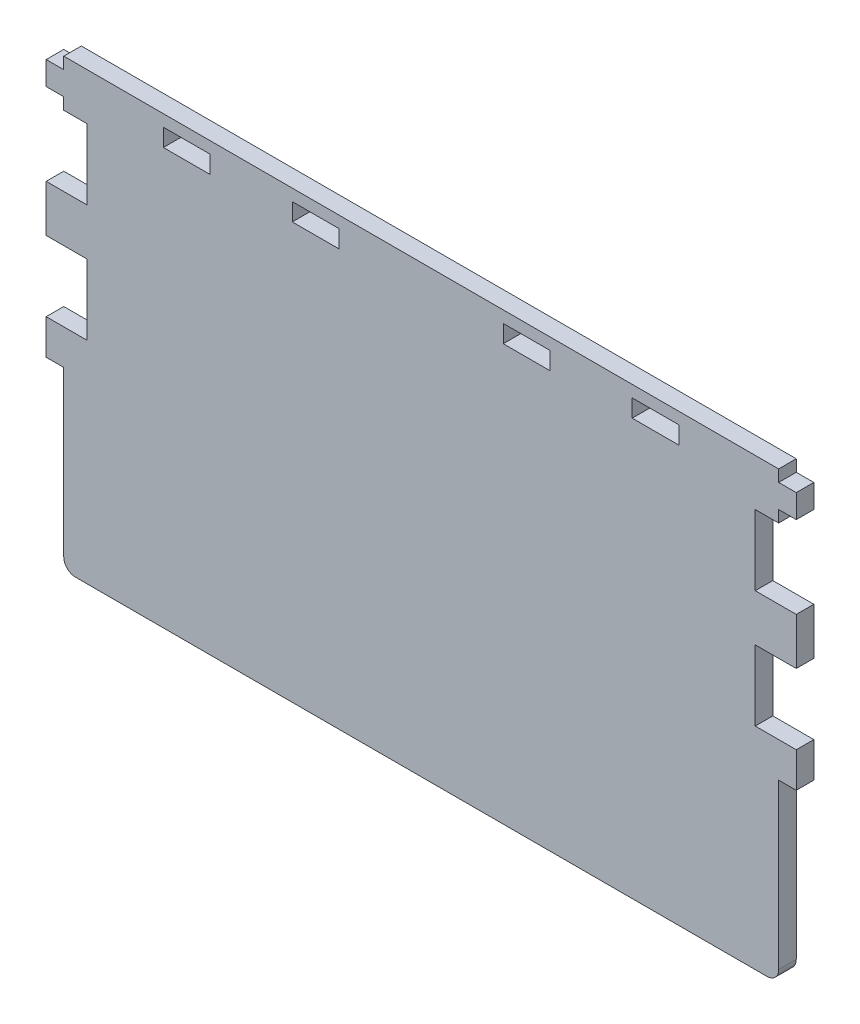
ISO-10303-21;
HEADER;
FILE_DESCRIPTION(('STEP AP214'),'2;1');
FILE_NAME('part.step','',(''),(''),'','','');
FILE_SCHEMA(('AUTOMOTIVE_DESIGN { 1 0 10303 214 1 1 1 1 }'));
ENDSEC;
DATA;
#1=APPLICATION_CONTEXT('core data for automotive mechanical design processes');
#2=APPLICATION_PROTOCOL_DEFINITION('international standard','automotive_design',2000,#1);
#3=PRODUCT_CONTEXT('',#1,'mechanical');
#4=PRODUCT('Part','Part','',(#3));
#5=PRODUCT_RELATED_PRODUCT_CATEGORY('part','',(#4));
#6=PRODUCT_DEFINITION_FORMATION('','',#4);
#7=PRODUCT_DEFINITION_CONTEXT('part definition',#1,'design');
#8=PRODUCT_DEFINITION('design','',#6,#7);
#9=PRODUCT_DEFINITION_SHAPE('','',#8);
#10=(LENGTH_UNIT() NAMED_UNIT(*) SI_UNIT(.MILLI.,.METRE.));
#11=(NAMED_UNIT(*) PLANE_ANGLE_UNIT() SI_UNIT($,.RADIAN.));
#12=(NAMED_UNIT(*) SI_UNIT($,.STERADIAN.) SOLID_ANGLE_UNIT());
#13=UNCERTAINTY_MEASURE_WITH_UNIT(LENGTH_MEASURE(1.E-05),#10,'distance_accuracy_value','');
#14=(GEOMETRIC_REPRESENTATION_CONTEXT(3) GLOBAL_UNCERTAINTY_ASSIGNED_CONTEXT((#13)) GLOBAL_UNIT_ASSIGNED_CONTEXT((#10,
#11,#12)) REPRESENTATION_CONTEXT('',''));
#15=CARTESIAN_POINT('',(0.,0.,0.));
#16=DIRECTION('',(0.,0.,1.));
#17=DIRECTION('',(1.,0.,0.));
#18=AXIS2_PLACEMENT_3D('',#15,#16,#17);
#19=CARTESIAN_POINT('',(610.,0.,15.));
#20=DIRECTION('',(-1.,0.,0.));
#21=DIRECTION('',(0.,0.,1.));
#22=AXIS2_PLACEMENT_3D('',#19,#20,#21);
#23=PLANE('',#22);
#24=DIRECTION('',(0.,0.,-1.));
#25=VECTOR('',#24,1.);
#26=CARTESIAN_POINT('',(610.,150.,15.));
#27=LINE('',#26,#25);
#28=CARTESIAN_POINT('',(610.,150.,15.));
#29=VERTEX_POINT('',#28);
#30=CARTESIAN_POINT('',(610.,150.,0.));
#31=VERTEX_POINT('',#30);
#32=EDGE_CURVE('E391',#29,#31,#27,.T.);
#33=ORIENTED_EDGE('',*,*,#32,.F.);
#34=DIRECTION('',(0.,1.,0.));
#35=VECTOR('',#34,1.);
#36=CARTESIAN_POINT('',(610.,0.,15.));
#37=LINE('',#36,#35);
#38=CARTESIAN_POINT('',(610.,10.,15.));
#39=VERTEX_POINT('',#38);
#40=EDGE_CURVE('E707',#39,#29,#37,.T.);
#41=ORIENTED_EDGE('',*,*,#40,.F.);
#42=DIRECTION('',(0.,0.,-1.));
#43=VECTOR('',#42,1.);
#44=CARTESIAN_POINT('',(610.,10.,15.));
#45=LINE('',#44,#43);
#46=CARTESIAN_POINT('',(610.,10.,0.));
#47=VERTEX_POINT('',#46);
#48=EDGE_CURVE('E12',#39,#47,#45,.T.);
#49=ORIENTED_EDGE('',*,*,#48,.T.);
#50=DIRECTION('',(0.,1.,0.));
#51=VECTOR('',#50,1.);
#52=CARTESIAN_POINT('',(610.,0.,0.));
#53=LINE('',#52,#51);
#54=EDGE_CURVE('E721',#47,#31,#53,.T.);
#55=ORIENTED_EDGE('',*,*,#54,.T.);
#56=EDGE_LOOP('',(#33,#41,#49,#55));
#57=FACE_BOUND('',#56,.T.);
#58=ADVANCED_FACE('F48',(#57),#23,.F.);
#59=DIRECTION('',(0.,0.,-1.));
#60=VECTOR('',#59,1.);
#61=CARTESIAN_POINT('',(610.,350.,15.));
#62=LINE('',#61,#60);
#63=CARTESIAN_POINT('',(610.,350.,15.));
#64=VERTEX_POINT('',#63);
#65=CARTESIAN_POINT('',(610.,350.,0.));
#66=VERTEX_POINT('',#65);
#67=EDGE_CURVE('E418',#64,#66,#62,.T.);
#68=ORIENTED_EDGE('',*,*,#67,.F.);
#69=CARTESIAN_POINT('',(610.,340.,15.));
#70=VERTEX_POINT('',#69);
#71=EDGE_CURVE('E711',#70,#64,#37,.T.);
#72=ORIENTED_EDGE('',*,*,#71,.F.);
#73=DIRECTION('',(0.,0.,1.));
#74=VECTOR('',#73,1.);
#75=CARTESIAN_POINT('',(610.,340.,15.));
#76=LINE('',#75,#74);
#77=CARTESIAN_POINT('',(610.,340.,0.));
#78=VERTEX_POINT('',#77);
#79=EDGE_CURVE('E376',#78,#70,#76,.T.);
#80=ORIENTED_EDGE('',*,*,#79,.F.);
#81=EDGE_CURVE('E725',#78,#66,#53,.T.);
#82=ORIENTED_EDGE('',*,*,#81,.T.);
#83=EDGE_LOOP('',(#68,#72,#80,#82));
#84=FACE_BOUND('',#83,.T.);
#85=ADVANCED_FACE('F874',(#84),#23,.F.);
#86=DIRECTION('',(0.,0.,1.));
#87=VECTOR('',#86,1.);
#88=CARTESIAN_POINT('',(610.,370.,15.));
#89=LINE('',#88,#87);
#90=CARTESIAN_POINT('',(610.,370.,0.));
#91=VERTEX_POINT('',#90);
#92=CARTESIAN_POINT('',(610.,370.,15.));
#93=VERTEX_POINT('',#92);
#94=EDGE_CURVE('E424',#91,#93,#89,.T.);
#95=ORIENTED_EDGE('',*,*,#94,.F.);
#96=CARTESIAN_POINT('',(610.,380.,0.));
#97=VERTEX_POINT('',#96);
#98=EDGE_CURVE('E720',#91,#97,#53,.T.);
#99=ORIENTED_EDGE('',*,*,#98,.T.);
#100=DIRECTION('',(0.,0.,-1.));
#101=VECTOR('',#100,1.);
#102=CARTESIAN_POINT('',(610.,380.,15.));
#103=LINE('',#102,#101);
#104=CARTESIAN_POINT('',(610.,380.,15.));
#105=VERTEX_POINT('',#104);
#106=EDGE_CURVE('E729',#105,#97,#103,.T.);
#107=ORIENTED_EDGE('',*,*,#106,.F.);
#108=EDGE_CURVE('E706',#93,#105,#37,.T.);
#109=ORIENTED_EDGE('',*,*,#108,.F.);
#110=EDGE_LOOP('',(#95,#99,#107,#109));
#111=FACE_BOUND('',#110,.T.);
#112=ADVANCED_FACE('F800',(#111),#23,.F.);
#113=CARTESIAN_POINT('',(0.,0.,15.));
#114=DIRECTION('',(1.,0.,0.));
#115=DIRECTION('',(0.,0.,-1.));
#116=AXIS2_PLACEMENT_3D('',#113,#114,#115);
#117=PLANE('',#116);
#118=DIRECTION('',(0.,-1.,0.));
#119=VECTOR('',#118,1.);
#120=CARTESIAN_POINT('',(0.,0.,0.));
#121=LINE('',#120,#119);
#122=CARTESIAN_POINT('',(0.,380.,0.));
#123=VERTEX_POINT('',#122);
#124=CARTESIAN_POINT('',(0.,370.,0.));
#125=VERTEX_POINT('',#124);
#126=EDGE_CURVE('E714',#123,#125,#121,.T.);
#127=ORIENTED_EDGE('',*,*,#126,.T.);
#128=DIRECTION('',(0.,0.,1.));
#129=VECTOR('',#128,1.);
#130=CARTESIAN_POINT('',(0.,370.,15.));
#131=LINE('',#130,#129);
#132=CARTESIAN_POINT('',(0.,370.,15.));
#133=VERTEX_POINT('',#132);
#134=EDGE_CURVE('E451',#125,#133,#131,.T.);
#135=ORIENTED_EDGE('',*,*,#134,.T.);
#136=DIRECTION('',(0.,-1.,0.));
#137=VECTOR('',#136,1.);
#138=CARTESIAN_POINT('',(0.,0.,15.));
#139=LINE('',#138,#137);
#140=CARTESIAN_POINT('',(0.,380.,15.));
#141=VERTEX_POINT('',#140);
#142=EDGE_CURVE('E699',#141,#133,#139,.T.);
#143=ORIENTED_EDGE('',*,*,#142,.F.);
#144=DIRECTION('',(0.,0.,-1.));
#145=VECTOR('',#144,1.);
#146=CARTESIAN_POINT('',(0.,380.,15.));
#147=LINE('',#146,#145);
#148=EDGE_CURVE('E713',#141,#123,#147,.T.);
#149=ORIENTED_EDGE('',*,*,#148,.T.);
#150=EDGE_LOOP('',(#127,#135,#143,#149));
#151=FACE_BOUND('',#150,.T.);
#152=ADVANCED_FACE('F810',(#151),#117,.F.);
#153=CARTESIAN_POINT('',(0.,350.,15.));
#154=VERTEX_POINT('',#153);
#155=CARTESIAN_POINT('',(0.,340.,15.));
#156=VERTEX_POINT('',#155);
#157=EDGE_CURVE('E703',#154,#156,#139,.T.);
#158=ORIENTED_EDGE('',*,*,#157,.F.);
#159=DIRECTION('',(0.,0.,-1.));
#160=VECTOR('',#159,1.);
#161=CARTESIAN_POINT('',(0.,350.,15.));
#162=LINE('',#161,#160);
#163=CARTESIAN_POINT('',(0.,350.,0.));
#164=VERTEX_POINT('',#163);
#165=EDGE_CURVE('E446',#154,#164,#162,.T.);
#166=ORIENTED_EDGE('',*,*,#165,.T.);
#167=CARTESIAN_POINT('',(0.,340.,0.));
#168=VERTEX_POINT('',#167);
#169=EDGE_CURVE('E717',#164,#168,#121,.T.);
#170=ORIENTED_EDGE('',*,*,#169,.T.);
#171=DIRECTION('',(0.,0.,1.));
#172=VECTOR('',#171,1.);
#173=CARTESIAN_POINT('',(0.,340.,15.));
#174=LINE('',#173,#172);
#175=EDGE_CURVE('E507',#168,#156,#174,.T.);
#176=ORIENTED_EDGE('',*,*,#175,.T.);
#177=EDGE_LOOP('',(#158,#166,#170,#176));
#178=FACE_BOUND('',#177,.T.);
#179=ADVANCED_FACE('F825',(#178),#117,.F.);
#180=CARTESIAN_POINT('',(0.,0.,15.));
#181=DIRECTION('',(0.,0.,-1.));
#182=DIRECTION('',(-1.,0.,0.));
#183=AXIS2_PLACEMENT_3D('',#180,#181,#182);
#184=PLANE('',#183);
#185=DIRECTION('',(0.,-1.,0.));
#186=VECTOR('',#185,1.);
#187=CARTESIAN_POINT('',(375.,370.,15.));
#188=LINE('',#187,#186);
#189=CARTESIAN_POINT('',(375.,370.,15.));
#190=VERTEX_POINT('',#189);
#191=CARTESIAN_POINT('',(375.,355.,15.));
#192=VERTEX_POINT('',#191);
#193=EDGE_CURVE('E624',#190,#192,#188,.T.);
#194=ORIENTED_EDGE('',*,*,#193,.F.);
#195=DIRECTION('',(-1.,0.,0.));
#196=VECTOR('',#195,1.);
#197=CARTESIAN_POINT('',(375.,370.,15.));
#198=LINE('',#197,#196);
#199=CARTESIAN_POINT('',(415.,370.,15.));
#200=VERTEX_POINT('',#199);
#201=EDGE_CURVE('E619',#200,#190,#198,.T.);
#202=ORIENTED_EDGE('',*,*,#201,.F.);
#203=DIRECTION('',(0.,1.,0.));
#204=VECTOR('',#203,1.);
#205=CARTESIAN_POINT('',(415.,370.,15.));
#206=LINE('',#205,#204);
#207=CARTESIAN_POINT('',(415.,355.,15.));
#208=VERTEX_POINT('',#207);
#209=EDGE_CURVE('E633',#208,#200,#206,.T.);
#210=ORIENTED_EDGE('',*,*,#209,.F.);
#211=DIRECTION('',(1.,0.,0.));
#212=VECTOR('',#211,1.);
#213=CARTESIAN_POINT('',(375.,355.,15.));
#214=LINE('',#213,#212);
#215=EDGE_CURVE('E636',#192,#208,#214,.T.);
#216=ORIENTED_EDGE('',*,*,#215,.F.);
#217=EDGE_LOOP('',(#194,#202,#210,#216));
#218=FACE_BOUND('',#217,.T.);
#219=DIRECTION('',(0.,1.,0.));
#220=VECTOR('',#219,1.);
#221=CARTESIAN_POINT('',(235.,370.,15.));
#222=LINE('',#221,#220);
#223=CARTESIAN_POINT('',(235.,355.,15.));
#224=VERTEX_POINT('',#223);
#225=CARTESIAN_POINT('',(235.,370.,15.));
#226=VERTEX_POINT('',#225);
#227=EDGE_CURVE('E668',#224,#226,#222,.T.);
#228=ORIENTED_EDGE('',*,*,#227,.F.);
#229=DIRECTION('',(1.,0.,0.));
#230=VECTOR('',#229,1.);
#231=CARTESIAN_POINT('',(235.,355.,15.));
#232=LINE('',#231,#230);
#233=CARTESIAN_POINT('',(195.,355.,15.));
#234=VERTEX_POINT('',#233);
#235=EDGE_CURVE('E676',#234,#224,#232,.T.);
#236=ORIENTED_EDGE('',*,*,#235,.F.);
#237=DIRECTION('',(0.,-1.,0.));
#238=VECTOR('',#237,1.);
#239=CARTESIAN_POINT('',(195.,370.,15.));
#240=LINE('',#239,#238);
#241=CARTESIAN_POINT('',(195.,370.,15.));
#242=VERTEX_POINT('',#241);
#243=EDGE_CURVE('E673',#242,#234,#240,.T.);
#244=ORIENTED_EDGE('',*,*,#243,.F.);
#245=DIRECTION('',(-1.,0.,0.));
#246=VECTOR('',#245,1.);
#247=CARTESIAN_POINT('',(235.,370.,15.));
#248=LINE('',#247,#246);
#249=EDGE_CURVE('E670',#226,#242,#248,.T.);
#250=ORIENTED_EDGE('',*,*,#249,.F.);
#251=EDGE_LOOP('',(#228,#236,#244,#250));
#252=FACE_BOUND('',#251,.T.);
#253=DIRECTION('',(0.,1.,0.));
#254=VECTOR('',#253,1.);
#255=CARTESIAN_POINT('',(125.,370.,15.));
#256=LINE('',#255,#254);
#257=CARTESIAN_POINT('',(125.,355.,15.));
#258=VERTEX_POINT('',#257);
#259=CARTESIAN_POINT('',(125.,370.,15.));
#260=VERTEX_POINT('',#259);
#261=EDGE_CURVE('E591',#258,#260,#256,.T.);
#262=ORIENTED_EDGE('',*,*,#261,.F.);
#263=DIRECTION('',(1.,0.,0.));
#264=VECTOR('',#263,1.);
#265=CARTESIAN_POINT('',(125.,355.,15.));
#266=LINE('',#265,#264);
#267=CARTESIAN_POINT('',(85.,355.,15.));
#268=VERTEX_POINT('',#267);
#269=EDGE_CURVE('E586',#268,#258,#266,.T.);
#270=ORIENTED_EDGE('',*,*,#269,.F.);
#271=DIRECTION('',(0.,-1.,0.));
#272=VECTOR('',#271,1.);
#273=CARTESIAN_POINT('',(85.,370.,15.));
#274=LINE('',#273,#272);
#275=CARTESIAN_POINT('',(85.,370.,15.));
#276=VERTEX_POINT('',#275);
#277=EDGE_CURVE('E602',#276,#268,#274,.T.);
#278=ORIENTED_EDGE('',*,*,#277,.F.);
#279=DIRECTION('',(-1.,0.,0.));
#280=VECTOR('',#279,1.);
#281=CARTESIAN_POINT('',(125.,370.,15.));
#282=LINE('',#281,#280);
#283=EDGE_CURVE('E605',#260,#276,#282,.T.);
#284=ORIENTED_EDGE('',*,*,#283,.F.);
#285=EDGE_LOOP('',(#262,#270,#278,#284));
#286=FACE_BOUND('',#285,.T.);
#287=DIRECTION('',(0.,-1.,0.));
#288=VECTOR('',#287,1.);
#289=CARTESIAN_POINT('',(485.,370.,15.));
#290=LINE('',#289,#288);
#291=CARTESIAN_POINT('',(485.,370.,15.));
#292=VERTEX_POINT('',#291);
#293=CARTESIAN_POINT('',(485.,355.,15.));
#294=VERTEX_POINT('',#293);
#295=EDGE_CURVE('E653',#292,#294,#290,.T.);
#296=ORIENTED_EDGE('',*,*,#295,.F.);
#297=DIRECTION('',(-1.,0.,0.));
#298=VECTOR('',#297,1.);
#299=CARTESIAN_POINT('',(485.,370.,15.));
#300=LINE('',#299,#298);
#301=CARTESIAN_POINT('',(525.,370.,15.));
#302=VERTEX_POINT('',#301);
#303=EDGE_CURVE('E648',#302,#292,#300,.T.);
#304=ORIENTED_EDGE('',*,*,#303,.F.);
#305=DIRECTION('',(0.,1.,0.));
#306=VECTOR('',#305,1.);
#307=CARTESIAN_POINT('',(525.,370.,15.));
#308=LINE('',#307,#306);
#309=CARTESIAN_POINT('',(525.,355.,15.));
#310=VERTEX_POINT('',#309);
#311=EDGE_CURVE('E662',#310,#302,#308,.T.);
#312=ORIENTED_EDGE('',*,*,#311,.F.);
#313=DIRECTION('',(1.,0.,0.));
#314=VECTOR('',#313,1.);
#315=CARTESIAN_POINT('',(485.,355.,15.));
#316=LINE('',#315,#314);
#317=EDGE_CURVE('E665',#294,#310,#316,.T.);
#318=ORIENTED_EDGE('',*,*,#317,.F.);
#319=EDGE_LOOP('',(#296,#304,#312,#318));
#320=FACE_BOUND('',#319,.T.);
#321=DIRECTION('',(0.,-1.,0.));
#322=VECTOR('',#321,1.);
#323=CARTESIAN_POINT('',(590.,0.,15.));
#324=LINE('',#323,#322);
#325=CARTESIAN_POINT('',(590.,340.,15.));
#326=VERTEX_POINT('',#325);
#327=CARTESIAN_POINT('',(590.,280.,15.));
#328=VERTEX_POINT('',#327);
#329=EDGE_CURVE('E476',#326,#328,#324,.T.);
#330=ORIENTED_EDGE('',*,*,#329,.F.);
#331=DIRECTION('',(1.,0.,0.));
#332=VECTOR('',#331,1.);
#333=CARTESIAN_POINT('',(590.,340.,15.));
#334=LINE('',#333,#332);
#335=EDGE_CURVE('E489',#326,#70,#334,.T.);
#336=ORIENTED_EDGE('',*,*,#335,.T.);
#337=ORIENTED_EDGE('',*,*,#71,.T.);
#338=DIRECTION('',(-1.,0.,0.));
#339=VECTOR('',#338,1.);
#340=CARTESIAN_POINT('',(625.,350.,15.));
#341=LINE('',#340,#339);
#342=CARTESIAN_POINT('',(625.,350.,15.));
#343=VERTEX_POINT('',#342);
#344=EDGE_CURVE('E443',#343,#64,#341,.T.);
#345=ORIENTED_EDGE('',*,*,#344,.F.);
#346=DIRECTION('',(0.,-1.,0.));
#347=VECTOR('',#346,1.);
#348=CARTESIAN_POINT('',(625.,0.,14.9999999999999));
#349=LINE('',#348,#347);
#350=CARTESIAN_POINT('',(625.,370.,15.));
#351=VERTEX_POINT('',#350);
#352=EDGE_CURVE('E420',#351,#343,#349,.T.);
#353=ORIENTED_EDGE('',*,*,#352,.F.);
#354=DIRECTION('',(-1.,0.,0.));
#355=VECTOR('',#354,1.);
#356=CARTESIAN_POINT('',(625.,370.,15.));
#357=LINE('',#356,#355);
#358=EDGE_CURVE('E430',#351,#93,#357,.T.);
#359=ORIENTED_EDGE('',*,*,#358,.T.);
#360=ORIENTED_EDGE('',*,*,#108,.T.);
#361=DIRECTION('',(-1.,0.,0.));
#362=VECTOR('',#361,1.);
#363=CARTESIAN_POINT('',(0.,380.,15.));
#364=LINE('',#363,#362);
#365=EDGE_CURVE('E710',#105,#141,#364,.T.);
#366=ORIENTED_EDGE('',*,*,#365,.T.);
#367=ORIENTED_EDGE('',*,*,#142,.T.);
#368=DIRECTION('',(1.,0.,0.));
#369=VECTOR('',#368,1.);
#370=CARTESIAN_POINT('',(-15.,370.,15.));
#371=LINE('',#370,#369);
#372=CARTESIAN_POINT('',(-15.,370.,15.));
#373=VERTEX_POINT('',#372);
#374=EDGE_CURVE('E464',#373,#133,#371,.T.);
#375=ORIENTED_EDGE('',*,*,#374,.F.);
#376=DIRECTION('',(0.,-1.,0.));
#377=VECTOR('',#376,1.);
#378=CARTESIAN_POINT('',(-15.,370.,15.));
#379=LINE('',#378,#377);
#380=CARTESIAN_POINT('',(-15.,350.,15.));
#381=VERTEX_POINT('',#380);
#382=EDGE_CURVE('E447',#373,#381,#379,.T.);
#383=ORIENTED_EDGE('',*,*,#382,.T.);
#384=DIRECTION('',(1.,0.,0.));
#385=VECTOR('',#384,1.);
#386=CARTESIAN_POINT('',(-15.,350.,15.));
#387=LINE('',#386,#385);
#388=EDGE_CURVE('E460',#381,#154,#387,.T.);
#389=ORIENTED_EDGE('',*,*,#388,.T.);
#390=ORIENTED_EDGE('',*,*,#157,.T.);
#391=DIRECTION('',(-1.,0.,0.));
#392=VECTOR('',#391,1.);
#393=CARTESIAN_POINT('',(20.,340.,15.));
#394=LINE('',#393,#392);
#395=CARTESIAN_POINT('',(20.,340.,15.));
#396=VERTEX_POINT('',#395);
#397=EDGE_CURVE('E515',#396,#156,#394,.T.);
#398=ORIENTED_EDGE('',*,*,#397,.F.);
#399=DIRECTION('',(0.,-1.,0.));
#400=VECTOR('',#399,1.);
#401=CARTESIAN_POINT('',(20.,340.,15.));
#402=LINE('',#401,#400);
#403=CARTESIAN_POINT('',(20.,280.,15.));
#404=VERTEX_POINT('',#403);
#405=EDGE_CURVE('E503',#396,#404,#402,.T.);
#406=ORIENTED_EDGE('',*,*,#405,.T.);
#407=DIRECTION('',(1.,0.,0.));
#408=VECTOR('',#407,1.);
#409=CARTESIAN_POINT('',(-15.,280.,15.));
#410=LINE('',#409,#408);
#411=CARTESIAN_POINT('',(-15.,280.,15.));
#412=VERTEX_POINT('',#411);
#413=EDGE_CURVE('E567',#412,#404,#410,.T.);
#414=ORIENTED_EDGE('',*,*,#413,.F.);
#415=DIRECTION('',(0.,-1.,0.));
#416=VECTOR('',#415,1.);
#417=CARTESIAN_POINT('',(-15.,280.,15.));
#418=LINE('',#417,#416);
#419=CARTESIAN_POINT('',(-15.,240.,15.));
#420=VERTEX_POINT('',#419);
#421=EDGE_CURVE('E554',#412,#420,#418,.T.);
#422=ORIENTED_EDGE('',*,*,#421,.T.);
#423=DIRECTION('',(1.,0.,0.));
#424=VECTOR('',#423,1.);
#425=CARTESIAN_POINT('',(-15.,240.,15.));
#426=LINE('',#425,#424);
#427=CARTESIAN_POINT('',(20.,240.,15.));
#428=VERTEX_POINT('',#427);
#429=EDGE_CURVE('E566',#420,#428,#426,.T.);
#430=ORIENTED_EDGE('',*,*,#429,.T.);
#431=DIRECTION('',(0.,-1.,0.));
#432=VECTOR('',#431,1.);
#433=CARTESIAN_POINT('',(20.,240.,15.));
#434=LINE('',#433,#432);
#435=CARTESIAN_POINT('',(20.,180.,15.));
#436=VERTEX_POINT('',#435);
#437=EDGE_CURVE('E518',#428,#436,#434,.T.);
#438=ORIENTED_EDGE('',*,*,#437,.T.);
#439=DIRECTION('',(-1.,0.,0.));
#440=VECTOR('',#439,1.);
#441=CARTESIAN_POINT('',(20.,180.,15.));
#442=LINE('',#441,#440);
#443=CARTESIAN_POINT('',(-15.,180.,15.));
#444=VERTEX_POINT('',#443);
#445=EDGE_CURVE('E492',#436,#444,#442,.T.);
#446=ORIENTED_EDGE('',*,*,#445,.T.);
#447=DIRECTION('',(0.,-1.,0.));
#448=VECTOR('',#447,1.);
#449=CARTESIAN_POINT('',(-15.,180.,15.));
#450=LINE('',#449,#448);
#451=CARTESIAN_POINT('',(-15.,150.,15.));
#452=VERTEX_POINT('',#451);
#453=EDGE_CURVE('E407',#444,#452,#450,.T.);
#454=ORIENTED_EDGE('',*,*,#453,.T.);
#455=DIRECTION('',(1.,0.,0.));
#456=VECTOR('',#455,1.);
#457=CARTESIAN_POINT('',(-15.,150.,15.));
#458=LINE('',#457,#456);
#459=CARTESIAN_POINT('',(0.,150.,15.));
#460=VERTEX_POINT('',#459);
#461=EDGE_CURVE('E413',#452,#460,#458,.T.);
#462=ORIENTED_EDGE('',*,*,#461,.T.);
#463=CARTESIAN_POINT('',(0.,10.,15.));
#464=VERTEX_POINT('',#463);
#465=EDGE_CURVE('E63',#460,#464,#139,.T.);
#466=ORIENTED_EDGE('',*,*,#465,.T.);
#467=CARTESIAN_POINT('',(10.,10.,15.));
#468=DIRECTION('',(0.,0.,-1.));
#469=DIRECTION('',(-1.,0.,0.));
#470=AXIS2_PLACEMENT_3D('',#467,#468,#469);
#471=CIRCLE('',#470,10.);
#472=CARTESIAN_POINT('',(10.,0.,15.));
#473=VERTEX_POINT('',#472);
#474=EDGE_CURVE('E56',#464,#473,#471,.F.);
#475=ORIENTED_EDGE('',*,*,#474,.T.);
#476=DIRECTION('',(1.,0.,0.));
#477=VECTOR('',#476,1.);
#478=CARTESIAN_POINT('',(0.,0.,15.));
#479=LINE('',#478,#477);
#480=CARTESIAN_POINT('',(600.,0.,15.));
#481=VERTEX_POINT('',#480);
#482=EDGE_CURVE('E702',#473,#481,#479,.T.);
#483=ORIENTED_EDGE('',*,*,#482,.T.);
#484=CARTESIAN_POINT('',(600.,10.,15.));
#485=DIRECTION('',(0.,0.,-1.));
#486=DIRECTION('',(-1.,0.,0.));
#487=AXIS2_PLACEMENT_3D('',#484,#485,#486);
#488=CIRCLE('',#487,10.);
#489=EDGE_CURVE('E744',#481,#39,#488,.F.);
#490=ORIENTED_EDGE('',*,*,#489,.T.);
#491=ORIENTED_EDGE('',*,*,#40,.T.);
#492=DIRECTION('',(-1.,0.,0.));
#493=VECTOR('',#492,1.);
#494=CARTESIAN_POINT('',(625.,150.,15.));
#495=LINE('',#494,#493);
#496=CARTESIAN_POINT('',(625.,150.,15.));
#497=VERTEX_POINT('',#496);
#498=EDGE_CURVE('E399',#497,#29,#495,.T.);
#499=ORIENTED_EDGE('',*,*,#498,.F.);
#500=DIRECTION('',(0.,-1.,0.));
#501=VECTOR('',#500,1.);
#502=CARTESIAN_POINT('',(625.,0.,15.));
#503=LINE('',#502,#501);
#504=CARTESIAN_POINT('',(625.,180.,15.));
#505=VERTEX_POINT('',#504);
#506=EDGE_CURVE('E385',#505,#497,#503,.T.);
#507=ORIENTED_EDGE('',*,*,#506,.F.);
#508=DIRECTION('',(1.,0.,0.));
#509=VECTOR('',#508,1.);
#510=CARTESIAN_POINT('',(590.,180.,15.));
#511=LINE('',#510,#509);
#512=CARTESIAN_POINT('',(590.,180.,15.));
#513=VERTEX_POINT('',#512);
#514=EDGE_CURVE('E377',#513,#505,#511,.T.);
#515=ORIENTED_EDGE('',*,*,#514,.F.);
#516=DIRECTION('',(0.,-1.,0.));
#517=VECTOR('',#516,1.);
#518=CARTESIAN_POINT('',(590.,0.,15.));
#519=LINE('',#518,#517);
#520=CARTESIAN_POINT('',(590.,240.,15.));
#521=VERTEX_POINT('',#520);
#522=EDGE_CURVE('E467',#521,#513,#519,.T.);
#523=ORIENTED_EDGE('',*,*,#522,.F.);
#524=DIRECTION('',(-1.,0.,0.));
#525=VECTOR('',#524,1.);
#526=CARTESIAN_POINT('',(625.,240.,15.));
#527=LINE('',#526,#525);
#528=CARTESIAN_POINT('',(625.,240.,15.));
#529=VERTEX_POINT('',#528);
#530=EDGE_CURVE('E552',#529,#521,#527,.T.);
#531=ORIENTED_EDGE('',*,*,#530,.F.);
#532=DIRECTION('',(0.,-1.,0.));
#533=VECTOR('',#532,1.);
#534=CARTESIAN_POINT('',(625.,0.,14.9999999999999));
#535=LINE('',#534,#533);
#536=CARTESIAN_POINT('',(625.,280.,15.));
#537=VERTEX_POINT('',#536);
#538=EDGE_CURVE('E524',#537,#529,#535,.T.);
#539=ORIENTED_EDGE('',*,*,#538,.F.);
#540=DIRECTION('',(-1.,0.,0.));
#541=VECTOR('',#540,1.);
#542=CARTESIAN_POINT('',(625.,280.,15.));
#543=LINE('',#542,#541);
#544=EDGE_CURVE('E546',#537,#328,#543,.T.);
#545=ORIENTED_EDGE('',*,*,#544,.T.);
#546=EDGE_LOOP('',(#330,#336,#337,#345,#353,#359,#360,#366,#367,#375,#383,#389,#390,#398,#406,
#414,#422,#430,#438,#446,#454,#462,#466,#475,#483,#490,#491,#499,#507,#515,#523,#531,#539,#545));
#547=FACE_BOUND('',#546,.T.);
#548=ADVANCED_FACE('F749',(#218,#252,#286,#320,#547),#184,.F.);
#549=CARTESIAN_POINT('',(0.,0.,0.));
#550=DIRECTION('',(0.,0.,-1.));
#551=DIRECTION('',(-1.,0.,0.));
#552=AXIS2_PLACEMENT_3D('',#549,#550,#551);
#553=PLANE('',#552);
#554=DIRECTION('',(1.,0.,0.));
#555=VECTOR('',#554,1.);
#556=CARTESIAN_POINT('',(590.,340.,0.));
#557=LINE('',#556,#555);
#558=CARTESIAN_POINT('',(590.,340.,0.));
#559=VERTEX_POINT('',#558);
#560=EDGE_CURVE('E487',#559,#78,#557,.T.);
#561=ORIENTED_EDGE('',*,*,#560,.F.);
#562=DIRECTION('',(0.,1.,0.));
#563=VECTOR('',#562,1.);
#564=CARTESIAN_POINT('',(590.,0.,0.));
#565=LINE('',#564,#563);
#566=CARTESIAN_POINT('',(590.,280.,0.));
#567=VERTEX_POINT('',#566);
#568=EDGE_CURVE('E482',#567,#559,#565,.T.);
#569=ORIENTED_EDGE('',*,*,#568,.F.);
#570=DIRECTION('',(-1.,0.,0.));
#571=VECTOR('',#570,1.);
#572=CARTESIAN_POINT('',(625.,280.,0.));
#573=LINE('',#572,#571);
#574=CARTESIAN_POINT('',(625.,280.,0.));
#575=VERTEX_POINT('',#574);
#576=EDGE_CURVE('E548',#575,#567,#573,.T.);
#577=ORIENTED_EDGE('',*,*,#576,.F.);
#578=DIRECTION('',(0.,1.,0.));
#579=VECTOR('',#578,1.);
#580=CARTESIAN_POINT('',(625.,0.,0.));
#581=LINE('',#580,#579);
#582=CARTESIAN_POINT('',(625.,240.,0.));
#583=VERTEX_POINT('',#582);
#584=EDGE_CURVE('E542',#583,#575,#581,.T.);
#585=ORIENTED_EDGE('',*,*,#584,.F.);
#586=DIRECTION('',(-1.,0.,0.));
#587=VECTOR('',#586,1.);
#588=CARTESIAN_POINT('',(625.,240.,0.));
#589=LINE('',#588,#587);
#590=CARTESIAN_POINT('',(590.,240.,0.));
#591=VERTEX_POINT('',#590);
#592=EDGE_CURVE('E550',#583,#591,#589,.T.);
#593=ORIENTED_EDGE('',*,*,#592,.T.);
#594=DIRECTION('',(0.,1.,0.));
#595=VECTOR('',#594,1.);
#596=CARTESIAN_POINT('',(590.,0.,0.));
#597=LINE('',#596,#595);
#598=CARTESIAN_POINT('',(590.,180.,0.));
#599=VERTEX_POINT('',#598);
#600=EDGE_CURVE('E373',#599,#591,#597,.T.);
#601=ORIENTED_EDGE('',*,*,#600,.F.);
#602=DIRECTION('',(1.,0.,0.));
#603=VECTOR('',#602,1.);
#604=CARTESIAN_POINT('',(590.,180.,0.));
#605=LINE('',#604,#603);
#606=CARTESIAN_POINT('',(625.,180.,0.));
#607=VERTEX_POINT('',#606);
#608=EDGE_CURVE('E364',#599,#607,#605,.T.);
#609=ORIENTED_EDGE('',*,*,#608,.T.);
#610=DIRECTION('',(0.,1.,0.));
#611=VECTOR('',#610,1.);
#612=CARTESIAN_POINT('',(625.,0.,0.));
#613=LINE('',#612,#611);
#614=CARTESIAN_POINT('',(625.,150.,0.));
#615=VERTEX_POINT('',#614);
#616=EDGE_CURVE('E371',#615,#607,#613,.T.);
#617=ORIENTED_EDGE('',*,*,#616,.F.);
#618=DIRECTION('',(-1.,0.,0.));
#619=VECTOR('',#618,1.);
#620=CARTESIAN_POINT('',(625.,150.,0.));
#621=LINE('',#620,#619);
#622=EDGE_CURVE('E396',#615,#31,#621,.T.);
#623=ORIENTED_EDGE('',*,*,#622,.T.);
#624=ORIENTED_EDGE('',*,*,#54,.F.);
#625=CARTESIAN_POINT('',(600.,10.,0.));
#626=DIRECTION('',(0.,0.,-1.));
#627=DIRECTION('',(-1.,0.,0.));
#628=AXIS2_PLACEMENT_3D('',#625,#626,#627);
#629=CIRCLE('',#628,10.);
#630=CARTESIAN_POINT('',(600.,0.,0.));
#631=VERTEX_POINT('',#630);
#632=EDGE_CURVE('E737',#47,#631,#629,.T.);
#633=ORIENTED_EDGE('',*,*,#632,.T.);
#634=DIRECTION('',(1.,0.,0.));
#635=VECTOR('',#634,1.);
#636=CARTESIAN_POINT('',(0.,0.,0.));
#637=LINE('',#636,#635);
#638=CARTESIAN_POINT('',(10.,0.,0.));
#639=VERTEX_POINT('',#638);
#640=EDGE_CURVE('E716',#639,#631,#637,.T.);
#641=ORIENTED_EDGE('',*,*,#640,.F.);
#642=CARTESIAN_POINT('',(10.,10.,0.));
#643=DIRECTION('',(0.,0.,-1.));
#644=DIRECTION('',(-1.,0.,0.));
#645=AXIS2_PLACEMENT_3D('',#642,#643,#644);
#646=CIRCLE('',#645,10.);
#647=CARTESIAN_POINT('',(0.,10.,0.));
#648=VERTEX_POINT('',#647);
#649=EDGE_CURVE('E739',#639,#648,#646,.T.);
#650=ORIENTED_EDGE('',*,*,#649,.T.);
#651=CARTESIAN_POINT('',(0.,150.,0.));
#652=VERTEX_POINT('',#651);
#653=EDGE_CURVE('E698',#652,#648,#121,.T.);
#654=ORIENTED_EDGE('',*,*,#653,.F.);
#655=DIRECTION('',(1.,0.,0.));
#656=VECTOR('',#655,1.);
#657=CARTESIAN_POINT('',(-15.,150.,0.));
#658=LINE('',#657,#656);
#659=CARTESIAN_POINT('',(-15.,150.,0.));
#660=VERTEX_POINT('',#659);
#661=EDGE_CURVE('E415',#660,#652,#658,.T.);
#662=ORIENTED_EDGE('',*,*,#661,.F.);
#663=DIRECTION('',(0.,1.,0.));
#664=VECTOR('',#663,1.);
#665=CARTESIAN_POINT('',(-15.,180.,0.));
#666=LINE('',#665,#664);
#667=CARTESIAN_POINT('',(-15.,180.,0.));
#668=VERTEX_POINT('',#667);
#669=EDGE_CURVE('E401',#660,#668,#666,.T.);
#670=ORIENTED_EDGE('',*,*,#669,.T.);
#671=DIRECTION('',(-1.,0.,0.));
#672=VECTOR('',#671,1.);
#673=CARTESIAN_POINT('',(20.,180.,0.));
#674=LINE('',#673,#672);
#675=CARTESIAN_POINT('',(20.,180.,0.));
#676=VERTEX_POINT('',#675);
#677=EDGE_CURVE('E526',#676,#668,#674,.T.);
#678=ORIENTED_EDGE('',*,*,#677,.F.);
#679=DIRECTION('',(0.,1.,0.));
#680=VECTOR('',#679,1.);
#681=CARTESIAN_POINT('',(20.,240.,0.));
#682=LINE('',#681,#680);
#683=CARTESIAN_POINT('',(20.,240.,0.));
#684=VERTEX_POINT('',#683);
#685=EDGE_CURVE('E531',#676,#684,#682,.T.);
#686=ORIENTED_EDGE('',*,*,#685,.T.);
#687=DIRECTION('',(1.,0.,0.));
#688=VECTOR('',#687,1.);
#689=CARTESIAN_POINT('',(-15.,240.,0.));
#690=LINE('',#689,#688);
#691=CARTESIAN_POINT('',(-15.,240.,0.));
#692=VERTEX_POINT('',#691);
#693=EDGE_CURVE('E572',#692,#684,#690,.T.);
#694=ORIENTED_EDGE('',*,*,#693,.F.);
#695=DIRECTION('',(0.,1.,0.));
#696=VECTOR('',#695,1.);
#697=CARTESIAN_POINT('',(-15.,280.,0.));
#698=LINE('',#697,#696);
#699=CARTESIAN_POINT('',(-15.,280.,0.));
#700=VERTEX_POINT('',#699);
#701=EDGE_CURVE('E560',#692,#700,#698,.T.);
#702=ORIENTED_EDGE('',*,*,#701,.T.);
#703=DIRECTION('',(1.,0.,0.));
#704=VECTOR('',#703,1.);
#705=CARTESIAN_POINT('',(-15.,280.,0.));
#706=LINE('',#705,#704);
#707=CARTESIAN_POINT('',(20.,280.,0.));
#708=VERTEX_POINT('',#707);
#709=EDGE_CURVE('E570',#700,#708,#706,.T.);
#710=ORIENTED_EDGE('',*,*,#709,.T.);
#711=DIRECTION('',(0.,1.,0.));
#712=VECTOR('',#711,1.);
#713=CARTESIAN_POINT('',(20.,340.,0.));
#714=LINE('',#713,#712);
#715=CARTESIAN_POINT('',(20.,340.,0.));
#716=VERTEX_POINT('',#715);
#717=EDGE_CURVE('E510',#708,#716,#714,.T.);
#718=ORIENTED_EDGE('',*,*,#717,.T.);
#719=DIRECTION('',(-1.,0.,0.));
#720=VECTOR('',#719,1.);
#721=CARTESIAN_POINT('',(20.,340.,0.));
#722=LINE('',#721,#720);
#723=EDGE_CURVE('E521',#716,#168,#722,.T.);
#724=ORIENTED_EDGE('',*,*,#723,.T.);
#725=ORIENTED_EDGE('',*,*,#169,.F.);
#726=DIRECTION('',(1.,0.,0.));
#727=VECTOR('',#726,1.);
#728=CARTESIAN_POINT('',(-15.,350.,0.));
#729=LINE('',#728,#727);
#730=CARTESIAN_POINT('',(-15.,350.,0.));
#731=VERTEX_POINT('',#730);
#732=EDGE_CURVE('E471',#731,#164,#729,.T.);
#733=ORIENTED_EDGE('',*,*,#732,.F.);
#734=DIRECTION('',(0.,1.,0.));
#735=VECTOR('',#734,1.);
#736=CARTESIAN_POINT('',(-15.,370.,0.));
#737=LINE('',#736,#735);
#738=CARTESIAN_POINT('',(-15.,370.,0.));
#739=VERTEX_POINT('',#738);
#740=EDGE_CURVE('E454',#731,#739,#737,.T.);
#741=ORIENTED_EDGE('',*,*,#740,.T.);
#742=DIRECTION('',(1.,0.,0.));
#743=VECTOR('',#742,1.);
#744=CARTESIAN_POINT('',(-15.,370.,0.));
#745=LINE('',#744,#743);
#746=EDGE_CURVE('E468',#739,#125,#745,.T.);
#747=ORIENTED_EDGE('',*,*,#746,.T.);
#748=ORIENTED_EDGE('',*,*,#126,.F.);
#749=DIRECTION('',(-1.,0.,0.));
#750=VECTOR('',#749,1.);
#751=CARTESIAN_POINT('',(0.,380.,0.));
#752=LINE('',#751,#750);
#753=EDGE_CURVE('E724',#97,#123,#752,.T.);
#754=ORIENTED_EDGE('',*,*,#753,.F.);
#755=ORIENTED_EDGE('',*,*,#98,.F.);
#756=DIRECTION('',(-1.,0.,0.));
#757=VECTOR('',#756,1.);
#758=CARTESIAN_POINT('',(625.,370.,0.));
#759=LINE('',#758,#757);
#760=CARTESIAN_POINT('',(625.,370.,0.));
#761=VERTEX_POINT('',#760);
#762=EDGE_CURVE('E437',#761,#91,#759,.T.);
#763=ORIENTED_EDGE('',*,*,#762,.F.);
#764=DIRECTION('',(0.,1.,0.));
#765=VECTOR('',#764,1.);
#766=CARTESIAN_POINT('',(625.,0.,0.));
#767=LINE('',#766,#765);
#768=CARTESIAN_POINT('',(625.,350.,0.));
#769=VERTEX_POINT('',#768);
#770=EDGE_CURVE('E426',#769,#761,#767,.T.);
#771=ORIENTED_EDGE('',*,*,#770,.F.);
#772=DIRECTION('',(-1.,0.,0.));
#773=VECTOR('',#772,1.);
#774=CARTESIAN_POINT('',(625.,350.,0.));
#775=LINE('',#774,#773);
#776=EDGE_CURVE('E440',#769,#66,#775,.T.);
#777=ORIENTED_EDGE('',*,*,#776,.T.);
#778=ORIENTED_EDGE('',*,*,#81,.F.);
#779=EDGE_LOOP('',(#561,#569,#577,#585,#593,#601,#609,#617,#623,#624,#633,#641,#650,#654,#662,
#670,#678,#686,#694,#702,#710,#718,#724,#725,#733,#741,#747,#748,#754,#755,#763,#771,#777,#778));
#780=FACE_BOUND('',#779,.T.);
#781=DIRECTION('',(1.,0.,0.));
#782=VECTOR('',#781,1.);
#783=CARTESIAN_POINT('',(235.,355.,0.));
#784=LINE('',#783,#782);
#785=CARTESIAN_POINT('',(195.,355.,0.));
#786=VERTEX_POINT('',#785);
#787=CARTESIAN_POINT('',(235.,355.,0.));
#788=VERTEX_POINT('',#787);
#789=EDGE_CURVE('E671',#786,#788,#784,.T.);
#790=ORIENTED_EDGE('',*,*,#789,.T.);
#791=DIRECTION('',(0.,1.,0.));
#792=VECTOR('',#791,1.);
#793=CARTESIAN_POINT('',(235.,370.,0.));
#794=LINE('',#793,#792);
#795=CARTESIAN_POINT('',(235.,370.,0.));
#796=VERTEX_POINT('',#795);
#797=EDGE_CURVE('E600',#788,#796,#794,.T.);
#798=ORIENTED_EDGE('',*,*,#797,.T.);
#799=DIRECTION('',(-1.,0.,0.));
#800=VECTOR('',#799,1.);
#801=CARTESIAN_POINT('',(235.,370.,0.));
#802=LINE('',#801,#800);
#803=CARTESIAN_POINT('',(195.,370.,0.));
#804=VERTEX_POINT('',#803);
#805=EDGE_CURVE('E681',#796,#804,#802,.T.);
#806=ORIENTED_EDGE('',*,*,#805,.T.);
#807=DIRECTION('',(0.,-1.,0.));
#808=VECTOR('',#807,1.);
#809=CARTESIAN_POINT('',(195.,370.,0.));
#810=LINE('',#809,#808);
#811=EDGE_CURVE('E684',#804,#786,#810,.T.);
#812=ORIENTED_EDGE('',*,*,#811,.T.);
#813=EDGE_LOOP('',(#790,#798,#806,#812));
#814=FACE_BOUND('',#813,.T.);
#815=DIRECTION('',(1.,0.,0.));
#816=VECTOR('',#815,1.);
#817=CARTESIAN_POINT('',(125.,355.,0.));
#818=LINE('',#817,#816);
#819=CARTESIAN_POINT('',(85.,355.,0.));
#820=VERTEX_POINT('',#819);
#821=CARTESIAN_POINT('',(125.,355.,0.));
#822=VERTEX_POINT('',#821);
#823=EDGE_CURVE('E587',#820,#822,#818,.T.);
#824=ORIENTED_EDGE('',*,*,#823,.T.);
#825=DIRECTION('',(0.,1.,0.));
#826=VECTOR('',#825,1.);
#827=CARTESIAN_POINT('',(125.,370.,0.));
#828=LINE('',#827,#826);
#829=CARTESIAN_POINT('',(125.,370.,0.));
#830=VERTEX_POINT('',#829);
#831=EDGE_CURVE('E597',#822,#830,#828,.T.);
#832=ORIENTED_EDGE('',*,*,#831,.T.);
#833=DIRECTION('',(-1.,0.,0.));
#834=VECTOR('',#833,1.);
#835=CARTESIAN_POINT('',(125.,370.,0.));
#836=LINE('',#835,#834);
#837=CARTESIAN_POINT('',(85.,370.,0.));
#838=VERTEX_POINT('',#837);
#839=EDGE_CURVE('E594',#830,#838,#836,.T.);
#840=ORIENTED_EDGE('',*,*,#839,.T.);
#841=DIRECTION('',(0.,-1.,0.));
#842=VECTOR('',#841,1.);
#843=CARTESIAN_POINT('',(85.,370.,0.));
#844=LINE('',#843,#842);
#845=EDGE_CURVE('E590',#838,#820,#844,.T.);
#846=ORIENTED_EDGE('',*,*,#845,.T.);
#847=EDGE_LOOP('',(#824,#832,#840,#846));
#848=FACE_BOUND('',#847,.T.);
#849=DIRECTION('',(-1.,0.,0.));
#850=VECTOR('',#849,1.);
#851=CARTESIAN_POINT('',(375.,370.,0.));
#852=LINE('',#851,#850);
#853=CARTESIAN_POINT('',(415.,370.,0.));
#854=VERTEX_POINT('',#853);
#855=CARTESIAN_POINT('',(375.,370.,0.));
#856=VERTEX_POINT('',#855);
#857=EDGE_CURVE('E620',#854,#856,#852,.T.);
#858=ORIENTED_EDGE('',*,*,#857,.T.);
#859=DIRECTION('',(0.,-1.,0.));
#860=VECTOR('',#859,1.);
#861=CARTESIAN_POINT('',(375.,370.,0.));
#862=LINE('',#861,#860);
#863=CARTESIAN_POINT('',(375.,355.,0.));
#864=VERTEX_POINT('',#863);
#865=EDGE_CURVE('E579',#856,#864,#862,.T.);
#866=ORIENTED_EDGE('',*,*,#865,.T.);
#867=DIRECTION('',(1.,0.,0.));
#868=VECTOR('',#867,1.);
#869=CARTESIAN_POINT('',(375.,355.,0.));
#870=LINE('',#869,#868);
#871=CARTESIAN_POINT('',(415.,355.,0.));
#872=VERTEX_POINT('',#871);
#873=EDGE_CURVE('E627',#864,#872,#870,.T.);
#874=ORIENTED_EDGE('',*,*,#873,.T.);
#875=DIRECTION('',(0.,1.,0.));
#876=VECTOR('',#875,1.);
#877=CARTESIAN_POINT('',(415.,370.,0.));
#878=LINE('',#877,#876);
#879=EDGE_CURVE('E623',#872,#854,#878,.T.);
#880=ORIENTED_EDGE('',*,*,#879,.T.);
#881=EDGE_LOOP('',(#858,#866,#874,#880));
#882=FACE_BOUND('',#881,.T.);
#883=DIRECTION('',(-1.,0.,0.));
#884=VECTOR('',#883,1.);
#885=CARTESIAN_POINT('',(485.,370.,0.));
#886=LINE('',#885,#884);
#887=CARTESIAN_POINT('',(525.,370.,0.));
#888=VERTEX_POINT('',#887);
#889=CARTESIAN_POINT('',(485.,370.,0.));
#890=VERTEX_POINT('',#889);
#891=EDGE_CURVE('E649',#888,#890,#886,.T.);
#892=ORIENTED_EDGE('',*,*,#891,.T.);
#893=DIRECTION('',(0.,-1.,0.));
#894=VECTOR('',#893,1.);
#895=CARTESIAN_POINT('',(485.,370.,0.));
#896=LINE('',#895,#894);
#897=CARTESIAN_POINT('',(485.,355.,0.));
#898=VERTEX_POINT('',#897);
#899=EDGE_CURVE('E612',#890,#898,#896,.T.);
#900=ORIENTED_EDGE('',*,*,#899,.T.);
#901=DIRECTION('',(1.,0.,0.));
#902=VECTOR('',#901,1.);
#903=CARTESIAN_POINT('',(485.,355.,0.));
#904=LINE('',#903,#902);
#905=CARTESIAN_POINT('',(525.,355.,0.));
#906=VERTEX_POINT('',#905);
#907=EDGE_CURVE('E656',#898,#906,#904,.T.);
#908=ORIENTED_EDGE('',*,*,#907,.T.);
#909=DIRECTION('',(0.,1.,0.));
#910=VECTOR('',#909,1.);
#911=CARTESIAN_POINT('',(525.,370.,0.));
#912=LINE('',#911,#910);
#913=EDGE_CURVE('E652',#906,#888,#912,.T.);
#914=ORIENTED_EDGE('',*,*,#913,.T.);
#915=EDGE_LOOP('',(#892,#900,#908,#914));
#916=FACE_BOUND('',#915,.T.);
#917=ADVANCED_FACE('F367',(#780,#814,#848,#882,#916),#553,.T.);
#918=ORIENTED_EDGE('',*,*,#465,.F.);
#919=DIRECTION('',(0.,0.,-1.));
#920=VECTOR('',#919,1.);
#921=CARTESIAN_POINT('',(0.,150.,0.));
#922=LINE('',#921,#920);
#923=EDGE_CURVE('E68',#460,#652,#922,.T.);
#924=ORIENTED_EDGE('',*,*,#923,.T.);
#925=ORIENTED_EDGE('',*,*,#653,.T.);
#926=DIRECTION('',(0.,0.,-1.));
#927=VECTOR('',#926,1.);
#928=CARTESIAN_POINT('',(0.,10.,15.));
#929=LINE('',#928,#927);
#930=EDGE_CURVE('E742',#648,#464,#929,.F.);
#931=ORIENTED_EDGE('',*,*,#930,.T.);
#932=EDGE_LOOP('',(#918,#924,#925,#931));
#933=FACE_BOUND('',#932,.T.);
#934=ADVANCED_FACE('F886',(#933),#117,.F.);
#935=CARTESIAN_POINT('',(0.,0.,15.));
#936=DIRECTION('',(0.,1.,0.));
#937=DIRECTION('',(0.,0.,1.));
#938=AXIS2_PLACEMENT_3D('',#935,#936,#937);
#939=PLANE('',#938);
#940=ORIENTED_EDGE('',*,*,#482,.F.);
#941=DIRECTION('',(0.,0.,-1.));
#942=VECTOR('',#941,1.);
#943=CARTESIAN_POINT('',(10.,0.,15.));
#944=LINE('',#943,#942);
#945=EDGE_CURVE('E734',#473,#639,#944,.T.);
#946=ORIENTED_EDGE('',*,*,#945,.T.);
#947=ORIENTED_EDGE('',*,*,#640,.T.);
#948=DIRECTION('',(0.,0.,-1.));
#949=VECTOR('',#948,1.);
#950=CARTESIAN_POINT('',(600.,0.,15.));
#951=LINE('',#950,#949);
#952=EDGE_CURVE('E732',#631,#481,#951,.F.);
#953=ORIENTED_EDGE('',*,*,#952,.T.);
#954=EDGE_LOOP('',(#940,#946,#947,#953));
#955=FACE_BOUND('',#954,.T.);
#956=ADVANCED_FACE('F755',(#955),#939,.F.);
#957=CARTESIAN_POINT('',(0.,380.,15.));
#958=DIRECTION('',(0.,-1.,0.));
#959=DIRECTION('',(1.,0.,0.));
#960=AXIS2_PLACEMENT_3D('',#957,#958,#959);
#961=PLANE('',#960);
#962=ORIENTED_EDGE('',*,*,#753,.T.);
#963=ORIENTED_EDGE('',*,*,#148,.F.);
#964=ORIENTED_EDGE('',*,*,#365,.F.);
#965=ORIENTED_EDGE('',*,*,#106,.T.);
#966=EDGE_LOOP('',(#962,#963,#964,#965));
#967=FACE_BOUND('',#966,.T.);
#968=ADVANCED_FACE('F805',(#967),#961,.F.);
#969=CARTESIAN_POINT('',(235.,370.,15.));
#970=DIRECTION('',(-1.,0.,0.));
#971=DIRECTION('',(0.,0.,1.));
#972=AXIS2_PLACEMENT_3D('',#969,#970,#971);
#973=PLANE('',#972);
#974=ORIENTED_EDGE('',*,*,#797,.F.);
#975=DIRECTION('',(0.,0.,-1.));
#976=VECTOR('',#975,1.);
#977=CARTESIAN_POINT('',(235.,355.,15.));
#978=LINE('',#977,#976);
#979=EDGE_CURVE('E678',#224,#788,#978,.T.);
#980=ORIENTED_EDGE('',*,*,#979,.F.);
#981=ORIENTED_EDGE('',*,*,#227,.T.);
#982=DIRECTION('',(0.,0.,-1.));
#983=VECTOR('',#982,1.);
#984=CARTESIAN_POINT('',(235.,370.,15.));
#985=LINE('',#984,#983);
#986=EDGE_CURVE('E695',#226,#796,#985,.T.);
#987=ORIENTED_EDGE('',*,*,#986,.T.);
#988=EDGE_LOOP('',(#974,#980,#981,#987));
#989=FACE_BOUND('',#988,.T.);
#990=ADVANCED_FACE('F903',(#989),#973,.T.);
#991=CARTESIAN_POINT('',(235.,370.,15.));
#992=DIRECTION('',(0.,-1.,0.));
#993=DIRECTION('',(0.,0.,-1.));
#994=AXIS2_PLACEMENT_3D('',#991,#992,#993);
#995=PLANE('',#994);
#996=ORIENTED_EDGE('',*,*,#805,.F.);
#997=ORIENTED_EDGE('',*,*,#986,.F.);
#998=ORIENTED_EDGE('',*,*,#249,.T.);
#999=DIRECTION('',(0.,0.,-1.));
#1000=VECTOR('',#999,1.);
#1001=CARTESIAN_POINT('',(195.,370.,15.));
#1002=LINE('',#1001,#1000);
#1003=EDGE_CURVE('E693',#242,#804,#1002,.T.);
#1004=ORIENTED_EDGE('',*,*,#1003,.T.);
#1005=EDGE_LOOP('',(#996,#997,#998,#1004));
#1006=FACE_BOUND('',#1005,.T.);
#1007=ADVANCED_FACE('F907',(#1006),#995,.T.);
#1008=CARTESIAN_POINT('',(195.,370.,15.));
#1009=DIRECTION('',(1.,0.,0.));
#1010=DIRECTION('',(0.,1.,0.));
#1011=AXIS2_PLACEMENT_3D('',#1008,#1009,#1010);
#1012=PLANE('',#1011);
#1013=ORIENTED_EDGE('',*,*,#811,.F.);
#1014=ORIENTED_EDGE('',*,*,#1003,.F.);
#1015=ORIENTED_EDGE('',*,*,#243,.T.);
#1016=DIRECTION('',(0.,0.,-1.));
#1017=VECTOR('',#1016,1.);
#1018=CARTESIAN_POINT('',(195.,355.,15.));
#1019=LINE('',#1018,#1017);
#1020=EDGE_CURVE('E691',#234,#786,#1019,.T.);
#1021=ORIENTED_EDGE('',*,*,#1020,.T.);
#1022=EDGE_LOOP('',(#1013,#1014,#1015,#1021));
#1023=FACE_BOUND('',#1022,.T.);
#1024=ADVANCED_FACE('F912',(#1023),#1012,.T.);
#1025=CARTESIAN_POINT('',(235.,355.,15.));
#1026=DIRECTION('',(0.,1.,0.));
#1027=DIRECTION('',(-1.,0.,0.));
#1028=AXIS2_PLACEMENT_3D('',#1025,#1026,#1027);
#1029=PLANE('',#1028);
#1030=ORIENTED_EDGE('',*,*,#789,.F.);
#1031=ORIENTED_EDGE('',*,*,#1020,.F.);
#1032=ORIENTED_EDGE('',*,*,#235,.T.);
#1033=ORIENTED_EDGE('',*,*,#979,.T.);
#1034=EDGE_LOOP('',(#1030,#1031,#1032,#1033));
#1035=FACE_BOUND('',#1034,.T.);
#1036=ADVANCED_FACE('F918',(#1035),#1029,.T.);
#1037=CARTESIAN_POINT('',(125.,370.,15.));
#1038=DIRECTION('',(-1.,0.,0.));
#1039=DIRECTION('',(0.,-1.,0.));
#1040=AXIS2_PLACEMENT_3D('',#1037,#1038,#1039);
#1041=PLANE('',#1040);
#1042=ORIENTED_EDGE('',*,*,#831,.F.);
#1043=DIRECTION('',(0.,0.,-1.));
#1044=VECTOR('',#1043,1.);
#1045=CARTESIAN_POINT('',(125.,355.,15.));
#1046=LINE('',#1045,#1044);
#1047=EDGE_CURVE('E583',#258,#822,#1046,.T.);
#1048=ORIENTED_EDGE('',*,*,#1047,.F.);
#1049=ORIENTED_EDGE('',*,*,#261,.T.);
#1050=DIRECTION('',(0.,0.,-1.));
#1051=VECTOR('',#1050,1.);
#1052=CARTESIAN_POINT('',(125.,370.,15.));
#1053=LINE('',#1052,#1051);
#1054=EDGE_CURVE('E575',#260,#830,#1053,.T.);
#1055=ORIENTED_EDGE('',*,*,#1054,.T.);
#1056=EDGE_LOOP('',(#1042,#1048,#1049,#1055));
#1057=FACE_BOUND('',#1056,.T.);
#1058=ADVANCED_FACE('F922',(#1057),#1041,.T.);
#1059=CARTESIAN_POINT('',(125.,370.,15.));
#1060=DIRECTION('',(0.,-1.,0.));
#1061=DIRECTION('',(0.,0.,-1.));
#1062=AXIS2_PLACEMENT_3D('',#1059,#1060,#1061);
#1063=PLANE('',#1062);
#1064=ORIENTED_EDGE('',*,*,#839,.F.);
#1065=ORIENTED_EDGE('',*,*,#1054,.F.);
#1066=ORIENTED_EDGE('',*,*,#283,.T.);
#1067=DIRECTION('',(0.,0.,-1.));
#1068=VECTOR('',#1067,1.);
#1069=CARTESIAN_POINT('',(85.,370.,15.));
#1070=LINE('',#1069,#1068);
#1071=EDGE_CURVE('E578',#276,#838,#1070,.T.);
#1072=ORIENTED_EDGE('',*,*,#1071,.T.);
#1073=EDGE_LOOP('',(#1064,#1065,#1066,#1072));
#1074=FACE_BOUND('',#1073,.T.);
#1075=ADVANCED_FACE('F963',(#1074),#1063,.T.);
#1076=CARTESIAN_POINT('',(85.,370.,15.));
#1077=DIRECTION('',(1.,0.,0.));
#1078=DIRECTION('',(0.,1.,0.));
#1079=AXIS2_PLACEMENT_3D('',#1076,#1077,#1078);
#1080=PLANE('',#1079);
#1081=ORIENTED_EDGE('',*,*,#845,.F.);
#1082=ORIENTED_EDGE('',*,*,#1071,.F.);
#1083=ORIENTED_EDGE('',*,*,#277,.T.);
#1084=DIRECTION('',(0.,0.,-1.));
#1085=VECTOR('',#1084,1.);
#1086=CARTESIAN_POINT('',(85.,355.,15.));
#1087=LINE('',#1086,#1085);
#1088=EDGE_CURVE('E581',#268,#820,#1087,.T.);
#1089=ORIENTED_EDGE('',*,*,#1088,.T.);
#1090=EDGE_LOOP('',(#1081,#1082,#1083,#1089));
#1091=FACE_BOUND('',#1090,.T.);
#1092=ADVANCED_FACE('F959',(#1091),#1080,.T.);
#1093=CARTESIAN_POINT('',(125.,355.,15.));
#1094=DIRECTION('',(0.,1.,0.));
#1095=DIRECTION('',(0.,0.,1.));
#1096=AXIS2_PLACEMENT_3D('',#1093,#1094,#1095);
#1097=PLANE('',#1096);
#1098=ORIENTED_EDGE('',*,*,#823,.F.);
#1099=ORIENTED_EDGE('',*,*,#1088,.F.);
#1100=ORIENTED_EDGE('',*,*,#269,.T.);
#1101=ORIENTED_EDGE('',*,*,#1047,.T.);
#1102=EDGE_LOOP('',(#1098,#1099,#1100,#1101));
#1103=FACE_BOUND('',#1102,.T.);
#1104=ADVANCED_FACE('F955',(#1103),#1097,.T.);
#1105=CARTESIAN_POINT('',(375.,370.,15.));
#1106=DIRECTION('',(1.,0.,0.));
#1107=DIRECTION('',(0.,0.,-1.));
#1108=AXIS2_PLACEMENT_3D('',#1105,#1106,#1107);
#1109=PLANE('',#1108);
#1110=ORIENTED_EDGE('',*,*,#865,.F.);
#1111=DIRECTION('',(0.,0.,-1.));
#1112=VECTOR('',#1111,1.);
#1113=CARTESIAN_POINT('',(375.,370.,15.));
#1114=LINE('',#1113,#1112);
#1115=EDGE_CURVE('E616',#190,#856,#1114,.T.);
#1116=ORIENTED_EDGE('',*,*,#1115,.F.);
#1117=ORIENTED_EDGE('',*,*,#193,.T.);
#1118=DIRECTION('',(0.,0.,-1.));
#1119=VECTOR('',#1118,1.);
#1120=CARTESIAN_POINT('',(375.,355.,15.));
#1121=LINE('',#1120,#1119);
#1122=EDGE_CURVE('E608',#192,#864,#1121,.T.);
#1123=ORIENTED_EDGE('',*,*,#1122,.T.);
#1124=EDGE_LOOP('',(#1110,#1116,#1117,#1123));
#1125=FACE_BOUND('',#1124,.T.);
#1126=ADVANCED_FACE('F951',(#1125),#1109,.T.);
#1127=CARTESIAN_POINT('',(375.,355.,15.));
#1128=DIRECTION('',(0.,1.,0.));
#1129=DIRECTION('',(0.,0.,1.));
#1130=AXIS2_PLACEMENT_3D('',#1127,#1128,#1129);
#1131=PLANE('',#1130);
#1132=ORIENTED_EDGE('',*,*,#873,.F.);
#1133=ORIENTED_EDGE('',*,*,#1122,.F.);
#1134=ORIENTED_EDGE('',*,*,#215,.T.);
#1135=DIRECTION('',(0.,0.,-1.));
#1136=VECTOR('',#1135,1.);
#1137=CARTESIAN_POINT('',(415.,355.,15.));
#1138=LINE('',#1137,#1136);
#1139=EDGE_CURVE('E611',#208,#872,#1138,.T.);
#1140=ORIENTED_EDGE('',*,*,#1139,.T.);
#1141=EDGE_LOOP('',(#1132,#1133,#1134,#1140));
#1142=FACE_BOUND('',#1141,.T.);
#1143=ADVANCED_FACE('F947',(#1142),#1131,.T.);
#1144=CARTESIAN_POINT('',(415.,370.,15.));
#1145=DIRECTION('',(-1.,0.,0.));
#1146=DIRECTION('',(0.,0.,1.));
#1147=AXIS2_PLACEMENT_3D('',#1144,#1145,#1146);
#1148=PLANE('',#1147);
#1149=ORIENTED_EDGE('',*,*,#879,.F.);
#1150=ORIENTED_EDGE('',*,*,#1139,.F.);
#1151=ORIENTED_EDGE('',*,*,#209,.T.);
#1152=DIRECTION('',(0.,0.,-1.));
#1153=VECTOR('',#1152,1.);
#1154=CARTESIAN_POINT('',(415.,370.,15.));
#1155=LINE('',#1154,#1153);
#1156=EDGE_CURVE('E614',#200,#854,#1155,.T.);
#1157=ORIENTED_EDGE('',*,*,#1156,.T.);
#1158=EDGE_LOOP('',(#1149,#1150,#1151,#1157));
#1159=FACE_BOUND('',#1158,.T.);
#1160=ADVANCED_FACE('F943',(#1159),#1148,.T.);
#1161=CARTESIAN_POINT('',(375.,370.,15.));
#1162=DIRECTION('',(0.,-1.,0.));
#1163=DIRECTION('',(0.,0.,-1.));
#1164=AXIS2_PLACEMENT_3D('',#1161,#1162,#1163);
#1165=PLANE('',#1164);
#1166=ORIENTED_EDGE('',*,*,#857,.F.);
#1167=ORIENTED_EDGE('',*,*,#1156,.F.);
#1168=ORIENTED_EDGE('',*,*,#201,.T.);
#1169=ORIENTED_EDGE('',*,*,#1115,.T.);
#1170=EDGE_LOOP('',(#1166,#1167,#1168,#1169));
#1171=FACE_BOUND('',#1170,.T.);
#1172=ADVANCED_FACE('F939',(#1171),#1165,.T.);
#1173=CARTESIAN_POINT('',(485.,370.,15.));
#1174=DIRECTION('',(1.,0.,0.));
#1175=DIRECTION('',(0.,0.,-1.));
#1176=AXIS2_PLACEMENT_3D('',#1173,#1174,#1175);
#1177=PLANE('',#1176);
#1178=ORIENTED_EDGE('',*,*,#899,.F.);
#1179=DIRECTION('',(0.,0.,-1.));
#1180=VECTOR('',#1179,1.);
#1181=CARTESIAN_POINT('',(485.,370.,15.));
#1182=LINE('',#1181,#1180);
#1183=EDGE_CURVE('E645',#292,#890,#1182,.T.);
#1184=ORIENTED_EDGE('',*,*,#1183,.F.);
#1185=ORIENTED_EDGE('',*,*,#295,.T.);
#1186=DIRECTION('',(0.,0.,-1.));
#1187=VECTOR('',#1186,1.);
#1188=CARTESIAN_POINT('',(485.,355.,15.));
#1189=LINE('',#1188,#1187);
#1190=EDGE_CURVE('E569',#294,#898,#1189,.T.);
#1191=ORIENTED_EDGE('',*,*,#1190,.T.);
#1192=EDGE_LOOP('',(#1178,#1184,#1185,#1191));
#1193=FACE_BOUND('',#1192,.T.);
#1194=ADVANCED_FACE('F935',(#1193),#1177,.T.);
#1195=CARTESIAN_POINT('',(485.,355.,15.));
#1196=DIRECTION('',(0.,1.,0.));
#1197=DIRECTION('',(-1.,0.,0.));
#1198=AXIS2_PLACEMENT_3D('',#1195,#1196,#1197);
#1199=PLANE('',#1198);
#1200=ORIENTED_EDGE('',*,*,#907,.F.);
#1201=ORIENTED_EDGE('',*,*,#1190,.F.);
#1202=ORIENTED_EDGE('',*,*,#317,.T.);
#1203=DIRECTION('',(0.,0.,-1.));
#1204=VECTOR('',#1203,1.);
#1205=CARTESIAN_POINT('',(525.,355.,15.));
#1206=LINE('',#1205,#1204);
#1207=EDGE_CURVE('E641',#310,#906,#1206,.T.);
#1208=ORIENTED_EDGE('',*,*,#1207,.T.);
#1209=EDGE_LOOP('',(#1200,#1201,#1202,#1208));
#1210=FACE_BOUND('',#1209,.T.);
#1211=ADVANCED_FACE('F931',(#1210),#1199,.T.);
#1212=CARTESIAN_POINT('',(525.,370.,15.));
#1213=DIRECTION('',(-1.,0.,0.));
#1214=DIRECTION('',(0.,0.,1.));
#1215=AXIS2_PLACEMENT_3D('',#1212,#1213,#1214);
#1216=PLANE('',#1215);
#1217=ORIENTED_EDGE('',*,*,#913,.F.);
#1218=ORIENTED_EDGE('',*,*,#1207,.F.);
#1219=ORIENTED_EDGE('',*,*,#311,.T.);
#1220=DIRECTION('',(0.,0.,-1.));
#1221=VECTOR('',#1220,1.);
#1222=CARTESIAN_POINT('',(525.,370.,15.));
#1223=LINE('',#1222,#1221);
#1224=EDGE_CURVE('E643',#302,#888,#1223,.T.);
#1225=ORIENTED_EDGE('',*,*,#1224,.T.);
#1226=EDGE_LOOP('',(#1217,#1218,#1219,#1225));
#1227=FACE_BOUND('',#1226,.T.);
#1228=ADVANCED_FACE('F927',(#1227),#1216,.T.);
#1229=CARTESIAN_POINT('',(485.,370.,15.));
#1230=DIRECTION('',(0.,-1.,0.));
#1231=DIRECTION('',(0.,0.,-1.));
#1232=AXIS2_PLACEMENT_3D('',#1229,#1230,#1231);
#1233=PLANE('',#1232);
#1234=ORIENTED_EDGE('',*,*,#891,.F.);
#1235=ORIENTED_EDGE('',*,*,#1224,.F.);
#1236=ORIENTED_EDGE('',*,*,#303,.T.);
#1237=ORIENTED_EDGE('',*,*,#1183,.T.);
#1238=EDGE_LOOP('',(#1234,#1235,#1236,#1237));
#1239=FACE_BOUND('',#1238,.T.);
#1240=ADVANCED_FACE('F924',(#1239),#1233,.T.);
#1241=CARTESIAN_POINT('',(10.,10.,15.));
#1242=DIRECTION('',(0.,0.,-1.));
#1243=DIRECTION('',(-1.,0.,0.));
#1244=AXIS2_PLACEMENT_3D('',#1241,#1242,#1243);
#1245=CYLINDRICAL_SURFACE('',#1244,10.);
#1246=ORIENTED_EDGE('',*,*,#474,.F.);
#1247=ORIENTED_EDGE('',*,*,#930,.F.);
#1248=ORIENTED_EDGE('',*,*,#649,.F.);
#1249=ORIENTED_EDGE('',*,*,#945,.F.);
#1250=EDGE_LOOP('',(#1246,#1247,#1248,#1249));
#1251=FACE_BOUND('',#1250,.T.);
#1252=ADVANCED_FACE('F758',(#1251),#1245,.T.);
#1253=CARTESIAN_POINT('',(600.,10.,15.));
#1254=DIRECTION('',(0.,0.,-1.));
#1255=DIRECTION('',(-1.,0.,0.));
#1256=AXIS2_PLACEMENT_3D('',#1253,#1254,#1255);
#1257=CYLINDRICAL_SURFACE('',#1256,10.);
#1258=ORIENTED_EDGE('',*,*,#489,.F.);
#1259=ORIENTED_EDGE('',*,*,#952,.F.);
#1260=ORIENTED_EDGE('',*,*,#632,.F.);
#1261=ORIENTED_EDGE('',*,*,#48,.F.);
#1262=EDGE_LOOP('',(#1258,#1259,#1260,#1261));
#1263=FACE_BOUND('',#1262,.T.);
#1264=ADVANCED_FACE('F50',(#1263),#1257,.T.);
#1265=CARTESIAN_POINT('',(-15.,280.,15.));
#1266=DIRECTION('',(0.,1.,0.));
#1267=DIRECTION('',(0.,0.,1.));
#1268=AXIS2_PLACEMENT_3D('',#1265,#1266,#1267);
#1269=PLANE('',#1268);
#1270=ORIENTED_EDGE('',*,*,#413,.T.);
#1271=DIRECTION('',(0.,0.,-1.));
#1272=VECTOR('',#1271,1.);
#1273=CARTESIAN_POINT('',(20.,280.,15.));
#1274=LINE('',#1273,#1272);
#1275=EDGE_CURVE('E506',#404,#708,#1274,.T.);
#1276=ORIENTED_EDGE('',*,*,#1275,.T.);
#1277=ORIENTED_EDGE('',*,*,#709,.F.);
#1278=DIRECTION('',(0.,0.,1.));
#1279=VECTOR('',#1278,1.);
#1280=CARTESIAN_POINT('',(-15.,280.,15.));
#1281=LINE('',#1280,#1279);
#1282=EDGE_CURVE('E563',#700,#412,#1281,.T.);
#1283=ORIENTED_EDGE('',*,*,#1282,.T.);
#1284=EDGE_LOOP('',(#1270,#1276,#1277,#1283));
#1285=FACE_BOUND('',#1284,.T.);
#1286=ADVANCED_FACE('F842',(#1285),#1269,.T.);
#1287=CARTESIAN_POINT('',(-15.,240.,15.));
#1288=DIRECTION('',(0.,-1.,0.));
#1289=DIRECTION('',(0.,0.,-1.));
#1290=AXIS2_PLACEMENT_3D('',#1287,#1288,#1289);
#1291=PLANE('',#1290);
#1292=ORIENTED_EDGE('',*,*,#693,.T.);
#1293=DIRECTION('',(0.,0.,1.));
#1294=VECTOR('',#1293,1.);
#1295=CARTESIAN_POINT('',(20.,240.,15.));
#1296=LINE('',#1295,#1294);
#1297=EDGE_CURVE('E528',#684,#428,#1296,.T.);
#1298=ORIENTED_EDGE('',*,*,#1297,.T.);
#1299=ORIENTED_EDGE('',*,*,#429,.F.);
#1300=DIRECTION('',(0.,0.,-1.));
#1301=VECTOR('',#1300,1.);
#1302=CARTESIAN_POINT('',(-15.,240.,15.));
#1303=LINE('',#1302,#1301);
#1304=EDGE_CURVE('E557',#420,#692,#1303,.T.);
#1305=ORIENTED_EDGE('',*,*,#1304,.T.);
#1306=EDGE_LOOP('',(#1292,#1298,#1299,#1305));
#1307=FACE_BOUND('',#1306,.T.);
#1308=ADVANCED_FACE('F844',(#1307),#1291,.T.);
#1309=CARTESIAN_POINT('',(-15.,0.,0.));
#1310=DIRECTION('',(1.,0.,0.));
#1311=DIRECTION('',(0.,0.,-1.));
#1312=AXIS2_PLACEMENT_3D('',#1309,#1310,#1311);
#1313=PLANE('',#1312);
#1314=ORIENTED_EDGE('',*,*,#421,.F.);
#1315=ORIENTED_EDGE('',*,*,#1282,.F.);
#1316=ORIENTED_EDGE('',*,*,#701,.F.);
#1317=ORIENTED_EDGE('',*,*,#1304,.F.);
#1318=EDGE_LOOP('',(#1314,#1315,#1316,#1317));
#1319=FACE_BOUND('',#1318,.T.);
#1320=ADVANCED_FACE('F840',(#1319),#1313,.F.);
#1321=CARTESIAN_POINT('',(625.,240.,15.));
#1322=DIRECTION('',(0.,1.,0.));
#1323=DIRECTION('',(0.,0.,1.));
#1324=AXIS2_PLACEMENT_3D('',#1321,#1322,#1323);
#1325=PLANE('',#1324);
#1326=ORIENTED_EDGE('',*,*,#530,.T.);
#1327=DIRECTION('',(0.,0.,1.));
#1328=VECTOR('',#1327,1.);
#1329=CARTESIAN_POINT('',(590.,240.,15.));
#1330=LINE('',#1329,#1328);
#1331=EDGE_CURVE('E499',#591,#521,#1330,.T.);
#1332=ORIENTED_EDGE('',*,*,#1331,.F.);
#1333=ORIENTED_EDGE('',*,*,#592,.F.);
#1334=DIRECTION('',(0.,0.,-1.));
#1335=VECTOR('',#1334,1.);
#1336=CARTESIAN_POINT('',(625.,240.,15.));
#1337=LINE('',#1336,#1335);
#1338=EDGE_CURVE('E540',#529,#583,#1337,.T.);
#1339=ORIENTED_EDGE('',*,*,#1338,.F.);
#1340=EDGE_LOOP('',(#1326,#1332,#1333,#1339));
#1341=FACE_BOUND('',#1340,.T.);
#1342=ADVANCED_FACE('F776',(#1341),#1325,.F.);
#1343=CARTESIAN_POINT('',(625.,280.,15.));
#1344=DIRECTION('',(0.,-1.,0.));
#1345=DIRECTION('',(0.,0.,-1.));
#1346=AXIS2_PLACEMENT_3D('',#1343,#1344,#1345);
#1347=PLANE('',#1346);
#1348=ORIENTED_EDGE('',*,*,#576,.T.);
#1349=DIRECTION('',(0.,0.,-1.));
#1350=VECTOR('',#1349,1.);
#1351=CARTESIAN_POINT('',(590.,280.,15.));
#1352=LINE('',#1351,#1350);
#1353=EDGE_CURVE('E479',#328,#567,#1352,.T.);
#1354=ORIENTED_EDGE('',*,*,#1353,.F.);
#1355=ORIENTED_EDGE('',*,*,#544,.F.);
#1356=DIRECTION('',(0.,0.,1.));
#1357=VECTOR('',#1356,1.);
#1358=CARTESIAN_POINT('',(625.,280.,15.));
#1359=LINE('',#1358,#1357);
#1360=EDGE_CURVE('E544',#575,#537,#1359,.T.);
#1361=ORIENTED_EDGE('',*,*,#1360,.F.);
#1362=EDGE_LOOP('',(#1348,#1354,#1355,#1361));
#1363=FACE_BOUND('',#1362,.T.);
#1364=ADVANCED_FACE('F784',(#1363),#1347,.F.);
#1365=CARTESIAN_POINT('',(625.,0.,0.));
#1366=DIRECTION('',(1.,0.,0.));
#1367=DIRECTION('',(0.,0.,-1.));
#1368=AXIS2_PLACEMENT_3D('',#1365,#1366,#1367);
#1369=PLANE('',#1368);
#1370=ORIENTED_EDGE('',*,*,#538,.T.);
#1371=ORIENTED_EDGE('',*,*,#1338,.T.);
#1372=ORIENTED_EDGE('',*,*,#584,.T.);
#1373=ORIENTED_EDGE('',*,*,#1360,.T.);
#1374=EDGE_LOOP('',(#1370,#1371,#1372,#1373));
#1375=FACE_BOUND('',#1374,.T.);
#1376=ADVANCED_FACE('F779',(#1375),#1369,.T.);
#1377=CARTESIAN_POINT('',(20.,180.,15.));
#1378=DIRECTION('',(0.,1.,0.));
#1379=DIRECTION('',(0.,0.,1.));
#1380=AXIS2_PLACEMENT_3D('',#1377,#1378,#1379);
#1381=PLANE('',#1380);
#1382=ORIENTED_EDGE('',*,*,#677,.T.);
#1383=DIRECTION('',(0.,0.,1.));
#1384=VECTOR('',#1383,1.);
#1385=CARTESIAN_POINT('',(-15.,180.,0.));
#1386=LINE('',#1385,#1384);
#1387=EDGE_CURVE('E404',#668,#444,#1386,.T.);
#1388=ORIENTED_EDGE('',*,*,#1387,.T.);
#1389=ORIENTED_EDGE('',*,*,#445,.F.);
#1390=DIRECTION('',(0.,0.,-1.));
#1391=VECTOR('',#1390,1.);
#1392=CARTESIAN_POINT('',(20.,180.,15.));
#1393=LINE('',#1392,#1391);
#1394=EDGE_CURVE('E534',#436,#676,#1393,.T.);
#1395=ORIENTED_EDGE('',*,*,#1394,.T.);
#1396=EDGE_LOOP('',(#1382,#1388,#1389,#1395));
#1397=FACE_BOUND('',#1396,.T.);
#1398=ADVANCED_FACE('F854',(#1397),#1381,.T.);
#1399=CARTESIAN_POINT('',(20.,0.,0.));
#1400=DIRECTION('',(1.,0.,0.));
#1401=DIRECTION('',(0.,0.,-1.));
#1402=AXIS2_PLACEMENT_3D('',#1399,#1400,#1401);
#1403=PLANE('',#1402);
#1404=ORIENTED_EDGE('',*,*,#437,.F.);
#1405=ORIENTED_EDGE('',*,*,#1297,.F.);
#1406=ORIENTED_EDGE('',*,*,#685,.F.);
#1407=ORIENTED_EDGE('',*,*,#1394,.F.);
#1408=EDGE_LOOP('',(#1404,#1405,#1406,#1407));
#1409=FACE_BOUND('',#1408,.T.);
#1410=ADVANCED_FACE('F850',(#1409),#1403,.F.);
#1411=CARTESIAN_POINT('',(20.,340.,15.));
#1412=DIRECTION('',(0.,-1.,0.));
#1413=DIRECTION('',(0.,0.,-1.));
#1414=AXIS2_PLACEMENT_3D('',#1411,#1412,#1413);
#1415=PLANE('',#1414);
#1416=ORIENTED_EDGE('',*,*,#175,.F.);
#1417=ORIENTED_EDGE('',*,*,#723,.F.);
#1418=DIRECTION('',(0.,0.,1.));
#1419=VECTOR('',#1418,1.);
#1420=CARTESIAN_POINT('',(20.,340.,15.));
#1421=LINE('',#1420,#1419);
#1422=EDGE_CURVE('E513',#716,#396,#1421,.T.);
#1423=ORIENTED_EDGE('',*,*,#1422,.T.);
#1424=ORIENTED_EDGE('',*,*,#397,.T.);
#1425=EDGE_LOOP('',(#1416,#1417,#1423,#1424));
#1426=FACE_BOUND('',#1425,.T.);
#1427=ADVANCED_FACE('F828',(#1426),#1415,.T.);
#1428=CARTESIAN_POINT('',(20.,0.,0.));
#1429=DIRECTION('',(1.,0.,0.));
#1430=DIRECTION('',(0.,0.,-1.));
#1431=AXIS2_PLACEMENT_3D('',#1428,#1429,#1430);
#1432=PLANE('',#1431);
#1433=ORIENTED_EDGE('',*,*,#405,.F.);
#1434=ORIENTED_EDGE('',*,*,#1422,.F.);
#1435=ORIENTED_EDGE('',*,*,#717,.F.);
#1436=ORIENTED_EDGE('',*,*,#1275,.F.);
#1437=EDGE_LOOP('',(#1433,#1434,#1435,#1436));
#1438=FACE_BOUND('',#1437,.T.);
#1439=ADVANCED_FACE('F834',(#1438),#1432,.F.);
#1440=CARTESIAN_POINT('',(590.,340.,15.));
#1441=DIRECTION('',(0.,1.,0.));
#1442=DIRECTION('',(0.,0.,1.));
#1443=AXIS2_PLACEMENT_3D('',#1440,#1441,#1442);
#1444=PLANE('',#1443);
#1445=ORIENTED_EDGE('',*,*,#79,.T.);
#1446=ORIENTED_EDGE('',*,*,#335,.F.);
#1447=DIRECTION('',(0.,0.,1.));
#1448=VECTOR('',#1447,1.);
#1449=CARTESIAN_POINT('',(590.,340.,15.));
#1450=LINE('',#1449,#1448);
#1451=EDGE_CURVE('E484',#559,#326,#1450,.T.);
#1452=ORIENTED_EDGE('',*,*,#1451,.F.);
#1453=ORIENTED_EDGE('',*,*,#560,.T.);
#1454=EDGE_LOOP('',(#1445,#1446,#1452,#1453));
#1455=FACE_BOUND('',#1454,.T.);
#1456=ADVANCED_FACE('F791',(#1455),#1444,.F.);
#1457=CARTESIAN_POINT('',(590.,0.,0.));
#1458=DIRECTION('',(1.,0.,0.));
#1459=DIRECTION('',(0.,0.,-1.));
#1460=AXIS2_PLACEMENT_3D('',#1457,#1458,#1459);
#1461=PLANE('',#1460);
#1462=ORIENTED_EDGE('',*,*,#329,.T.);
#1463=ORIENTED_EDGE('',*,*,#1353,.T.);
#1464=ORIENTED_EDGE('',*,*,#568,.T.);
#1465=ORIENTED_EDGE('',*,*,#1451,.T.);
#1466=EDGE_LOOP('',(#1462,#1463,#1464,#1465));
#1467=FACE_BOUND('',#1466,.T.);
#1468=ADVANCED_FACE('F788',(#1467),#1461,.T.);
#1469=CARTESIAN_POINT('',(590.,180.,15.));
#1470=DIRECTION('',(0.,-1.,0.));
#1471=DIRECTION('',(0.,0.,-1.));
#1472=AXIS2_PLACEMENT_3D('',#1469,#1470,#1471);
#1473=PLANE('',#1472);
#1474=ORIENTED_EDGE('',*,*,#514,.T.);
#1475=DIRECTION('',(0.,0.,1.));
#1476=VECTOR('',#1475,1.);
#1477=CARTESIAN_POINT('',(625.,180.,15.));
#1478=LINE('',#1477,#1476);
#1479=EDGE_CURVE('E380',#607,#505,#1478,.T.);
#1480=ORIENTED_EDGE('',*,*,#1479,.F.);
#1481=ORIENTED_EDGE('',*,*,#608,.F.);
#1482=DIRECTION('',(0.,0.,-1.));
#1483=VECTOR('',#1482,1.);
#1484=CARTESIAN_POINT('',(590.,180.,15.));
#1485=LINE('',#1484,#1483);
#1486=EDGE_CURVE('E496',#513,#599,#1485,.T.);
#1487=ORIENTED_EDGE('',*,*,#1486,.F.);
#1488=EDGE_LOOP('',(#1474,#1480,#1481,#1487));
#1489=FACE_BOUND('',#1488,.T.);
#1490=ADVANCED_FACE('F381',(#1489),#1473,.F.);
#1491=CARTESIAN_POINT('',(590.,0.,0.));
#1492=DIRECTION('',(1.,0.,0.));
#1493=DIRECTION('',(0.,0.,-1.));
#1494=AXIS2_PLACEMENT_3D('',#1491,#1492,#1493);
#1495=PLANE('',#1494);
#1496=ORIENTED_EDGE('',*,*,#522,.T.);
#1497=ORIENTED_EDGE('',*,*,#1486,.T.);
#1498=ORIENTED_EDGE('',*,*,#600,.T.);
#1499=ORIENTED_EDGE('',*,*,#1331,.T.);
#1500=EDGE_LOOP('',(#1496,#1497,#1498,#1499));
#1501=FACE_BOUND('',#1500,.T.);
#1502=ADVANCED_FACE('F772',(#1501),#1495,.T.);
#1503=CARTESIAN_POINT('',(-15.,370.,15.));
#1504=DIRECTION('',(0.,1.,0.));
#1505=DIRECTION('',(0.,0.,1.));
#1506=AXIS2_PLACEMENT_3D('',#1503,#1504,#1505);
#1507=PLANE('',#1506);
#1508=ORIENTED_EDGE('',*,*,#134,.F.);
#1509=ORIENTED_EDGE('',*,*,#746,.F.);
#1510=DIRECTION('',(0.,0.,1.));
#1511=VECTOR('',#1510,1.);
#1512=CARTESIAN_POINT('',(-15.,370.,15.));
#1513=LINE('',#1512,#1511);
#1514=EDGE_CURVE('E457',#739,#373,#1513,.T.);
#1515=ORIENTED_EDGE('',*,*,#1514,.T.);
#1516=ORIENTED_EDGE('',*,*,#374,.T.);
#1517=EDGE_LOOP('',(#1508,#1509,#1515,#1516));
#1518=FACE_BOUND('',#1517,.T.);
#1519=ADVANCED_FACE('F814',(#1518),#1507,.T.);
#1520=CARTESIAN_POINT('',(-15.,350.,15.));
#1521=DIRECTION('',(0.,-1.,0.));
#1522=DIRECTION('',(0.,0.,-1.));
#1523=AXIS2_PLACEMENT_3D('',#1520,#1521,#1522);
#1524=PLANE('',#1523);
#1525=ORIENTED_EDGE('',*,*,#165,.F.);
#1526=ORIENTED_EDGE('',*,*,#388,.F.);
#1527=DIRECTION('',(0.,0.,-1.));
#1528=VECTOR('',#1527,1.);
#1529=CARTESIAN_POINT('',(-15.,350.,15.));
#1530=LINE('',#1529,#1528);
#1531=EDGE_CURVE('E450',#381,#731,#1530,.T.);
#1532=ORIENTED_EDGE('',*,*,#1531,.T.);
#1533=ORIENTED_EDGE('',*,*,#732,.T.);
#1534=EDGE_LOOP('',(#1525,#1526,#1532,#1533));
#1535=FACE_BOUND('',#1534,.T.);
#1536=ADVANCED_FACE('F823',(#1535),#1524,.T.);
#1537=CARTESIAN_POINT('',(-15.,0.,0.));
#1538=DIRECTION('',(1.,0.,0.));
#1539=DIRECTION('',(0.,0.,-1.));
#1540=AXIS2_PLACEMENT_3D('',#1537,#1538,#1539);
#1541=PLANE('',#1540);
#1542=ORIENTED_EDGE('',*,*,#382,.F.);
#1543=ORIENTED_EDGE('',*,*,#1514,.F.);
#1544=ORIENTED_EDGE('',*,*,#740,.F.);
#1545=ORIENTED_EDGE('',*,*,#1531,.F.);
#1546=EDGE_LOOP('',(#1542,#1543,#1544,#1545));
#1547=FACE_BOUND('',#1546,.T.);
#1548=ADVANCED_FACE('F818',(#1547),#1541,.F.);
#1549=CARTESIAN_POINT('',(625.,350.,15.));
#1550=DIRECTION('',(0.,1.,0.));
#1551=DIRECTION('',(0.,0.,1.));
#1552=AXIS2_PLACEMENT_3D('',#1549,#1550,#1551);
#1553=PLANE('',#1552);
#1554=ORIENTED_EDGE('',*,*,#67,.T.);
#1555=ORIENTED_EDGE('',*,*,#776,.F.);
#1556=DIRECTION('',(0.,0.,-1.));
#1557=VECTOR('',#1556,1.);
#1558=CARTESIAN_POINT('',(625.,350.,15.));
#1559=LINE('',#1558,#1557);
#1560=EDGE_CURVE('E423',#343,#769,#1559,.T.);
#1561=ORIENTED_EDGE('',*,*,#1560,.F.);
#1562=ORIENTED_EDGE('',*,*,#344,.T.);
#1563=EDGE_LOOP('',(#1554,#1555,#1561,#1562));
#1564=FACE_BOUND('',#1563,.T.);
#1565=ADVANCED_FACE('F1005',(#1564),#1553,.F.);
#1566=CARTESIAN_POINT('',(625.,370.,15.));
#1567=DIRECTION('',(0.,-1.,0.));
#1568=DIRECTION('',(0.,0.,-1.));
#1569=AXIS2_PLACEMENT_3D('',#1566,#1567,#1568);
#1570=PLANE('',#1569);
#1571=ORIENTED_EDGE('',*,*,#94,.T.);
#1572=ORIENTED_EDGE('',*,*,#358,.F.);
#1573=DIRECTION('',(0.,0.,1.));
#1574=VECTOR('',#1573,1.);
#1575=CARTESIAN_POINT('',(625.,370.,15.));
#1576=LINE('',#1575,#1574);
#1577=EDGE_CURVE('E428',#761,#351,#1576,.T.);
#1578=ORIENTED_EDGE('',*,*,#1577,.F.);
#1579=ORIENTED_EDGE('',*,*,#762,.T.);
#1580=EDGE_LOOP('',(#1571,#1572,#1578,#1579));
#1581=FACE_BOUND('',#1580,.T.);
#1582=ADVANCED_FACE('F870',(#1581),#1570,.F.);
#1583=CARTESIAN_POINT('',(625.,0.,0.));
#1584=DIRECTION('',(1.,0.,0.));
#1585=DIRECTION('',(0.,0.,-1.));
#1586=AXIS2_PLACEMENT_3D('',#1583,#1584,#1585);
#1587=PLANE('',#1586);
#1588=ORIENTED_EDGE('',*,*,#352,.T.);
#1589=ORIENTED_EDGE('',*,*,#1560,.T.);
#1590=ORIENTED_EDGE('',*,*,#770,.T.);
#1591=ORIENTED_EDGE('',*,*,#1577,.T.);
#1592=EDGE_LOOP('',(#1588,#1589,#1590,#1591));
#1593=FACE_BOUND('',#1592,.T.);
#1594=ADVANCED_FACE('F863',(#1593),#1587,.T.);
#1595=CARTESIAN_POINT('',(-15.,150.,0.));
#1596=DIRECTION('',(0.,-1.,0.));
#1597=DIRECTION('',(0.,0.,-1.));
#1598=AXIS2_PLACEMENT_3D('',#1595,#1596,#1597);
#1599=PLANE('',#1598);
#1600=ORIENTED_EDGE('',*,*,#923,.F.);
#1601=ORIENTED_EDGE('',*,*,#461,.F.);
#1602=DIRECTION('',(0.,0.,-1.));
#1603=VECTOR('',#1602,1.);
#1604=CARTESIAN_POINT('',(-15.,150.,0.));
#1605=LINE('',#1604,#1603);
#1606=EDGE_CURVE('E410',#452,#660,#1605,.T.);
#1607=ORIENTED_EDGE('',*,*,#1606,.T.);
#1608=ORIENTED_EDGE('',*,*,#661,.T.);
#1609=EDGE_LOOP('',(#1600,#1601,#1607,#1608));
#1610=FACE_BOUND('',#1609,.T.);
#1611=ADVANCED_FACE('F861',(#1610),#1599,.T.);
#1612=CARTESIAN_POINT('',(-15.,0.,0.));
#1613=DIRECTION('',(-1.,0.,0.));
#1614=DIRECTION('',(0.,0.,1.));
#1615=AXIS2_PLACEMENT_3D('',#1612,#1613,#1614);
#1616=PLANE('',#1615);
#1617=ORIENTED_EDGE('',*,*,#669,.F.);
#1618=ORIENTED_EDGE('',*,*,#1606,.F.);
#1619=ORIENTED_EDGE('',*,*,#453,.F.);
#1620=ORIENTED_EDGE('',*,*,#1387,.F.);
#1621=EDGE_LOOP('',(#1617,#1618,#1619,#1620));
#1622=FACE_BOUND('',#1621,.T.);
#1623=ADVANCED_FACE('F858',(#1622),#1616,.T.);
#1624=CARTESIAN_POINT('',(625.,150.,15.));
#1625=DIRECTION('',(0.,1.,0.));
#1626=DIRECTION('',(0.,0.,1.));
#1627=AXIS2_PLACEMENT_3D('',#1624,#1625,#1626);
#1628=PLANE('',#1627);
#1629=ORIENTED_EDGE('',*,*,#32,.T.);
#1630=ORIENTED_EDGE('',*,*,#622,.F.);
#1631=DIRECTION('',(0.,0.,-1.));
#1632=VECTOR('',#1631,1.);
#1633=CARTESIAN_POINT('',(625.,150.,15.));
#1634=LINE('',#1633,#1632);
#1635=EDGE_CURVE('E389',#497,#615,#1634,.T.);
#1636=ORIENTED_EDGE('',*,*,#1635,.F.);
#1637=ORIENTED_EDGE('',*,*,#498,.T.);
#1638=EDGE_LOOP('',(#1629,#1630,#1636,#1637));
#1639=FACE_BOUND('',#1638,.T.);
#1640=ADVANCED_FACE('F767',(#1639),#1628,.F.);
#1641=CARTESIAN_POINT('',(625.,0.,0.));
#1642=DIRECTION('',(1.,0.,0.));
#1643=DIRECTION('',(0.,0.,-1.));
#1644=AXIS2_PLACEMENT_3D('',#1641,#1642,#1643);
#1645=PLANE('',#1644);
#1646=ORIENTED_EDGE('',*,*,#616,.T.);
#1647=ORIENTED_EDGE('',*,*,#1479,.T.);
#1648=ORIENTED_EDGE('',*,*,#506,.T.);
#1649=ORIENTED_EDGE('',*,*,#1635,.T.);
#1650=EDGE_LOOP('',(#1646,#1647,#1648,#1649));
#1651=FACE_BOUND('',#1650,.T.);
#1652=ADVANCED_FACE('F387',(#1651),#1645,.T.);
#1653=CLOSED_SHELL('',(#58,#85,#112,#152,#179,#548,#917,#934,#956,#968,#990,#1007,#1024,#1036,
#1058,#1075,#1092,#1104,#1126,#1143,#1160,#1172,#1194,#1211,#1228,#1240,#1252,#1264,#1286,#1308,
#1320,#1342,#1364,#1376,#1398,#1410,#1427,#1439,#1456,#1468,#1490,#1502,#1519,#1536,#1548,#1565,
#1582,#1594,#1611,#1623,#1640,#1652));
#1654=MANIFOLD_SOLID_BREP('B2',#1653);
#1655=ADVANCED_BREP_SHAPE_REPRESENTATION('',(#18,#1654),#14);
#1656=SHAPE_DEFINITION_REPRESENTATION(#9,#1655);
ENDSEC;
END-ISO-10303-21;
